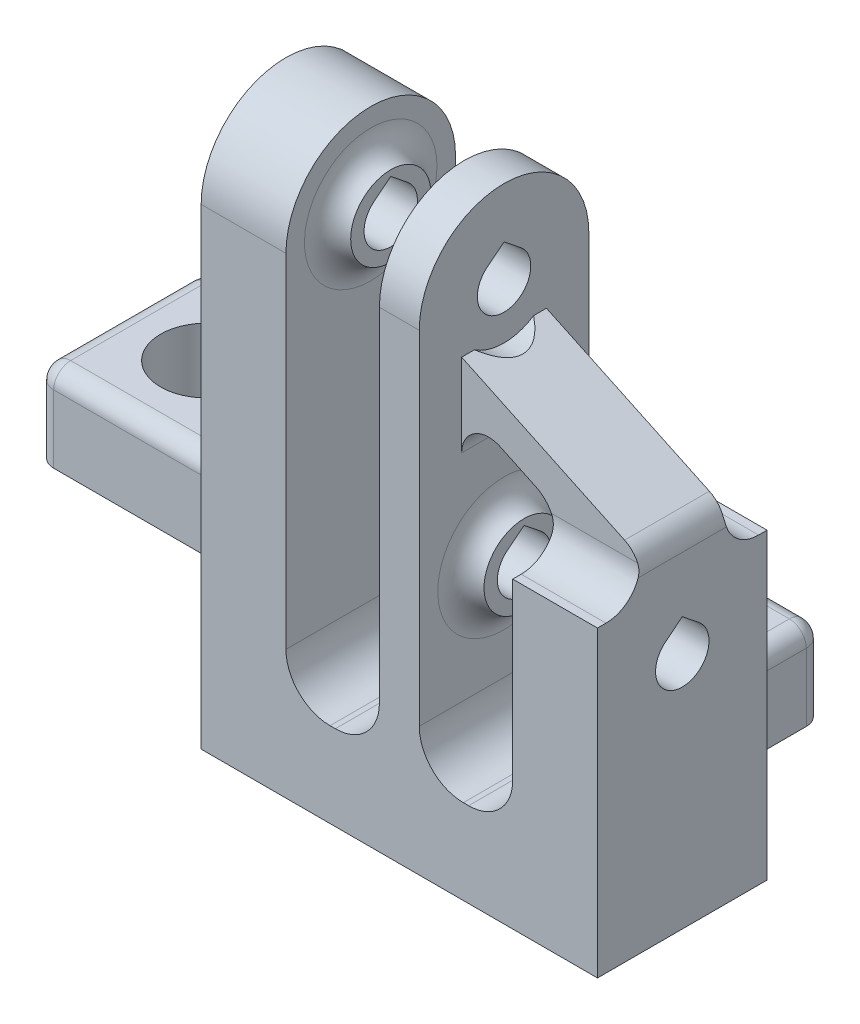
ISO-10303-21;
HEADER;
FILE_DESCRIPTION(('STEP AP214'),'2;1');
FILE_NAME('part.step','',(''),(''),'','','');
FILE_SCHEMA(('AUTOMOTIVE_DESIGN { 1 0 10303 214 1 1 1 1 }'));
ENDSEC;
DATA;
#1=APPLICATION_CONTEXT('core data for automotive mechanical design processes');
#2=APPLICATION_PROTOCOL_DEFINITION('international standard','automotive_design',2000,#1);
#3=PRODUCT_CONTEXT('',#1,'mechanical');
#4=PRODUCT('Part','Part','',(#3));
#5=PRODUCT_RELATED_PRODUCT_CATEGORY('part','',(#4));
#6=PRODUCT_DEFINITION_FORMATION('','',#4);
#7=PRODUCT_DEFINITION_CONTEXT('part definition',#1,'design');
#8=PRODUCT_DEFINITION('design','',#6,#7);
#9=PRODUCT_DEFINITION_SHAPE('','',#8);
#10=(LENGTH_UNIT() NAMED_UNIT(*) SI_UNIT(.MILLI.,.METRE.));
#11=(NAMED_UNIT(*) PLANE_ANGLE_UNIT() SI_UNIT($,.RADIAN.));
#12=(NAMED_UNIT(*) SI_UNIT($,.STERADIAN.) SOLID_ANGLE_UNIT());
#13=UNCERTAINTY_MEASURE_WITH_UNIT(LENGTH_MEASURE(1.E-05),#10,'distance_accuracy_value','');
#14=(GEOMETRIC_REPRESENTATION_CONTEXT(3) GLOBAL_UNCERTAINTY_ASSIGNED_CONTEXT((#13)) GLOBAL_UNIT_ASSIGNED_CONTEXT((#10,
#11,#12)) REPRESENTATION_CONTEXT('',''));
#15=CARTESIAN_POINT('',(0.,0.,0.));
#16=DIRECTION('',(0.,0.,1.));
#17=DIRECTION('',(1.,0.,0.));
#18=AXIS2_PLACEMENT_3D('',#15,#16,#17);
#19=CARTESIAN_POINT('',(-8.492499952,0.,0.));
#20=DIRECTION('',(-1.,0.,0.));
#21=DIRECTION('',(0.,-1.,0.));
#22=AXIS2_PLACEMENT_3D('',#19,#20,#21);
#23=PLANE('',#22);
#24=CARTESIAN_POINT('',(-8.492499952,14.493379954,6.35));
#25=DIRECTION('',(-1.,0.,0.));
#26=DIRECTION('',(0.,-1.,0.));
#27=AXIS2_PLACEMENT_3D('',#24,#25,#26);
#28=CIRCLE('',#27,4.96112212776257);
#29=CARTESIAN_POINT('',(-8.492499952,9.53225782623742,6.35));
#30=VERTEX_POINT('',#29);
#31=EDGE_CURVE('E459',#30,#30,#28,.T.);
#32=ORIENTED_EDGE('',*,*,#31,.T.);
#33=EDGE_LOOP('',(#32));
#34=FACE_BOUND('',#33,.T.);
#35=CARTESIAN_POINT('',(-8.492499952,14.493379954,6.35));
#36=DIRECTION('',(-1.,0.,0.));
#37=DIRECTION('',(0.,-1.,0.));
#38=AXIS2_PLACEMENT_3D('',#35,#36,#37);
#39=CIRCLE('',#38,6.35);
#40=CARTESIAN_POINT('',(-8.49249995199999,14.493379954,12.7));
#41=VERTEX_POINT('',#40);
#42=CARTESIAN_POINT('',(-8.49249995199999,14.493379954,0.));
#43=VERTEX_POINT('',#42);
#44=EDGE_CURVE('E812',#41,#43,#39,.T.);
#45=ORIENTED_EDGE('',*,*,#44,.F.);
#46=DIRECTION('',(0.,-1.,0.));
#47=VECTOR('',#46,1.);
#48=CARTESIAN_POINT('',(-8.492499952,0.,12.7));
#49=LINE('',#48,#47);
#50=CARTESIAN_POINT('',(-8.492499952,-11.191379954,12.7));
#51=VERTEX_POINT('',#50);
#52=EDGE_CURVE('E875',#41,#51,#49,.T.);
#53=ORIENTED_EDGE('',*,*,#52,.T.);
#54=DIRECTION('',(0.,0.,1.));
#55=VECTOR('',#54,1.);
#56=CARTESIAN_POINT('',(-8.492499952,-11.191379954,0.));
#57=LINE('',#56,#55);
#58=CARTESIAN_POINT('',(-8.492499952,-11.191379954,0.));
#59=VERTEX_POINT('',#58);
#60=EDGE_CURVE('E951',#51,#59,#57,.F.);
#61=ORIENTED_EDGE('',*,*,#60,.T.);
#62=DIRECTION('',(0.,-1.,0.));
#63=VECTOR('',#62,1.);
#64=CARTESIAN_POINT('',(-8.492499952,0.,0.));
#65=LINE('',#64,#63);
#66=EDGE_CURVE('E874',#43,#59,#65,.T.);
#67=ORIENTED_EDGE('',*,*,#66,.F.);
#68=EDGE_LOOP('',(#45,#53,#61,#67));
#69=FACE_BOUND('',#68,.T.);
#70=ADVANCED_FACE('F53',(#34,#69),#23,.F.);
#71=CARTESIAN_POINT('',(1.492499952,0.,12.7));
#72=DIRECTION('',(1.,0.,0.));
#73=DIRECTION('',(0.,1.,0.));
#74=AXIS2_PLACEMENT_3D('',#71,#72,#73);
#75=PLANE('',#74);
#76=DIRECTION('',(0.,0.624810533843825,0.780776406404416));
#77=VECTOR('',#76,1.);
#78=CARTESIAN_POINT('',(1.492499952,16.0549327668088,5.10037893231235));
#79=LINE('',#78,#77);
#80=CARTESIAN_POINT('',(1.492499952,16.0549327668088,5.10037893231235));
#81=VERTEX_POINT('',#80);
#82=CARTESIAN_POINT('',(1.492499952,17.0549327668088,6.35));
#83=VERTEX_POINT('',#82);
#84=EDGE_CURVE('E774',#81,#83,#79,.T.);
#85=ORIENTED_EDGE('',*,*,#84,.F.);
#86=CARTESIAN_POINT('',(1.492499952,14.493379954,6.35));
#87=DIRECTION('',(1.,0.,0.));
#88=DIRECTION('',(0.,1.,0.));
#89=AXIS2_PLACEMENT_3D('',#86,#87,#88);
#90=CIRCLE('',#89,2.);
#91=CARTESIAN_POINT('',(1.492499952,16.0549327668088,7.59962106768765));
#92=VERTEX_POINT('',#91);
#93=EDGE_CURVE('E919',#92,#81,#90,.T.);
#94=ORIENTED_EDGE('',*,*,#93,.F.);
#95=DIRECTION('',(0.,-0.624810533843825,0.780776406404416));
#96=VECTOR('',#95,1.);
#97=CARTESIAN_POINT('',(1.492499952,17.0549327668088,6.35));
#98=LINE('',#97,#96);
#99=EDGE_CURVE('E779',#83,#92,#98,.T.);
#100=ORIENTED_EDGE('',*,*,#99,.F.);
#101=EDGE_LOOP('',(#85,#94,#100));
#102=FACE_BOUND('',#101,.T.);
#103=CARTESIAN_POINT('',(1.492499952,-3.14438004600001,6.35));
#104=DIRECTION('',(1.,0.,0.));
#105=DIRECTION('',(0.,1.,0.));
#106=AXIS2_PLACEMENT_3D('',#103,#104,#105);
#107=CIRCLE('',#106,4.96112212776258);
#108=CARTESIAN_POINT('',(1.492499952,1.81674208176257,6.35));
#109=VERTEX_POINT('',#108);
#110=EDGE_CURVE('E468',#109,#109,#107,.F.);
#111=ORIENTED_EDGE('',*,*,#110,.T.);
#112=EDGE_LOOP('',(#111));
#113=FACE_BOUND('',#112,.T.);
#114=DIRECTION('',(0.,0.,1.));
#115=VECTOR('',#114,1.);
#116=CARTESIAN_POINT('',(1.492499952,4.95534722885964,12.7));
#117=LINE('',#116,#115);
#118=CARTESIAN_POINT('',(1.492499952,4.95534722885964,3.175));
#119=VERTEX_POINT('',#118);
#120=CARTESIAN_POINT('',(1.492499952,4.95534722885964,9.525));
#121=VERTEX_POINT('',#120);
#122=EDGE_CURVE('E446',#119,#121,#117,.T.);
#123=ORIENTED_EDGE('',*,*,#122,.T.);
#124=DIRECTION('',(0.,1.,0.));
#125=VECTOR('',#124,1.);
#126=CARTESIAN_POINT('',(1.492499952,0.,9.525));
#127=LINE('',#126,#125);
#128=CARTESIAN_POINT('',(1.492499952,11.1627065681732,9.525));
#129=VERTEX_POINT('',#128);
#130=EDGE_CURVE('E831',#121,#129,#127,.T.);
#131=ORIENTED_EDGE('',*,*,#130,.T.);
#132=DIRECTION('',(0.,0.,1.));
#133=VECTOR('',#132,1.);
#134=CARTESIAN_POINT('',(1.492499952,11.1627065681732,3.175));
#135=LINE('',#134,#133);
#136=CARTESIAN_POINT('',(1.492499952,11.1627065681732,8.56508798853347));
#137=VERTEX_POINT('',#136);
#138=EDGE_CURVE('E828',#137,#129,#135,.T.);
#139=ORIENTED_EDGE('',*,*,#138,.F.);
#140=CARTESIAN_POINT('',(1.492499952,14.493379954,6.35));
#141=DIRECTION('',(1.,0.,0.));
#142=DIRECTION('',(0.,1.,0.));
#143=AXIS2_PLACEMENT_3D('',#140,#141,#142);
#144=CIRCLE('',#143,4.);
#145=CARTESIAN_POINT('',(1.492499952,11.1627065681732,4.13491201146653));
#146=VERTEX_POINT('',#145);
#147=EDGE_CURVE('E816',#137,#146,#144,.T.);
#148=ORIENTED_EDGE('',*,*,#147,.T.);
#149=CARTESIAN_POINT('',(1.492499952,11.1627065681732,3.175));
#150=VERTEX_POINT('',#149);
#151=EDGE_CURVE('E836',#150,#146,#135,.T.);
#152=ORIENTED_EDGE('',*,*,#151,.F.);
#153=DIRECTION('',(0.,1.,0.));
#154=VECTOR('',#153,1.);
#155=CARTESIAN_POINT('',(1.492499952,0.,3.175));
#156=LINE('',#155,#154);
#157=EDGE_CURVE('E822',#119,#150,#156,.T.);
#158=ORIENTED_EDGE('',*,*,#157,.F.);
#159=EDGE_LOOP('',(#123,#131,#139,#148,#152,#158));
#160=FACE_BOUND('',#159,.T.);
#161=CARTESIAN_POINT('',(1.492499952,14.493379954,6.35));
#162=DIRECTION('',(1.,0.,0.));
#163=DIRECTION('',(0.,1.,0.));
#164=AXIS2_PLACEMENT_3D('',#161,#162,#163);
#165=CIRCLE('',#164,6.35);
#166=CARTESIAN_POINT('',(1.492499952,14.493379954,0.));
#167=VERTEX_POINT('',#166);
#168=CARTESIAN_POINT('',(1.49249995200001,14.493379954,12.7));
#169=VERTEX_POINT('',#168);
#170=EDGE_CURVE('E810',#167,#169,#165,.T.);
#171=ORIENTED_EDGE('',*,*,#170,.T.);
#172=DIRECTION('',(0.,-1.,0.));
#173=VECTOR('',#172,1.);
#174=CARTESIAN_POINT('',(1.492499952,0.,12.7));
#175=LINE('',#174,#173);
#176=CARTESIAN_POINT('',(1.492499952,-11.191379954,12.7));
#177=VERTEX_POINT('',#176);
#178=EDGE_CURVE('E925',#169,#177,#175,.T.);
#179=ORIENTED_EDGE('',*,*,#178,.T.);
#180=DIRECTION('',(0.,0.,-1.));
#181=VECTOR('',#180,1.);
#182=CARTESIAN_POINT('',(1.492499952,-11.191379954,12.7));
#183=LINE('',#182,#181);
#184=CARTESIAN_POINT('',(1.492499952,-11.191379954,0.));
#185=VERTEX_POINT('',#184);
#186=EDGE_CURVE('E431',#177,#185,#183,.T.);
#187=ORIENTED_EDGE('',*,*,#186,.T.);
#188=DIRECTION('',(0.,-1.,0.));
#189=VECTOR('',#188,1.);
#190=CARTESIAN_POINT('',(1.492499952,0.,0.));
#191=LINE('',#190,#189);
#192=EDGE_CURVE('E926',#167,#185,#191,.T.);
#193=ORIENTED_EDGE('',*,*,#192,.F.);
#194=EDGE_LOOP('',(#171,#179,#187,#193));
#195=FACE_BOUND('',#194,.T.);
#196=ADVANCED_FACE('F628',(#102,#113,#160,#195),#75,.T.);
#197=CARTESIAN_POINT('',(-1.492499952,0.,12.7));
#198=DIRECTION('',(1.,0.,0.));
#199=DIRECTION('',(0.,1.,0.));
#200=AXIS2_PLACEMENT_3D('',#197,#198,#199);
#201=PLANE('',#200);
#202=CARTESIAN_POINT('',(-1.492499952,14.493379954,6.35));
#203=DIRECTION('',(1.,0.,0.));
#204=DIRECTION('',(0.,1.,0.));
#205=AXIS2_PLACEMENT_3D('',#202,#203,#204);
#206=CIRCLE('',#205,4.96112212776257);
#207=CARTESIAN_POINT('',(-1.492499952,19.4545020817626,6.35));
#208=VERTEX_POINT('',#207);
#209=EDGE_CURVE('E462',#208,#208,#206,.T.);
#210=ORIENTED_EDGE('',*,*,#209,.T.);
#211=EDGE_LOOP('',(#210));
#212=FACE_BOUND('',#211,.T.);
#213=CARTESIAN_POINT('',(-1.492499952,-3.14438004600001,6.35));
#214=DIRECTION('',(1.,0.,0.));
#215=DIRECTION('',(0.,1.,0.));
#216=AXIS2_PLACEMENT_3D('',#213,#214,#215);
#217=CIRCLE('',#216,2.);
#218=CARTESIAN_POINT('',(-1.492499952,-1.58282723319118,5.10037893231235));
#219=VERTEX_POINT('',#218);
#220=CARTESIAN_POINT('',(-1.492499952,-1.58282723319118,7.59962106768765));
#221=VERTEX_POINT('',#220);
#222=EDGE_CURVE('E910',#219,#221,#217,.F.);
#223=ORIENTED_EDGE('',*,*,#222,.F.);
#224=DIRECTION('',(0.,-0.624810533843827,-0.780776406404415));
#225=VECTOR('',#224,1.);
#226=CARTESIAN_POINT('',(-1.492499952,-1.58282723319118,5.10037893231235));
#227=LINE('',#226,#225);
#228=CARTESIAN_POINT('',(-1.492499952,-0.582827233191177,6.35));
#229=VERTEX_POINT('',#228);
#230=EDGE_CURVE('E751',#229,#219,#227,.T.);
#231=ORIENTED_EDGE('',*,*,#230,.F.);
#232=DIRECTION('',(0.,0.624810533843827,-0.780776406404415));
#233=VECTOR('',#232,1.);
#234=CARTESIAN_POINT('',(-1.492499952,-0.582827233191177,6.35));
#235=LINE('',#234,#233);
#236=EDGE_CURVE('E753',#221,#229,#235,.T.);
#237=ORIENTED_EDGE('',*,*,#236,.F.);
#238=EDGE_LOOP('',(#223,#231,#237));
#239=FACE_BOUND('',#238,.T.);
#240=DIRECTION('',(0.,-1.,0.));
#241=VECTOR('',#240,1.);
#242=CARTESIAN_POINT('',(-1.492499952,0.,12.7));
#243=LINE('',#242,#241);
#244=CARTESIAN_POINT('',(-1.49249995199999,14.493379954,12.7));
#245=VERTEX_POINT('',#244);
#246=CARTESIAN_POINT('',(-1.492499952,-11.191379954,12.7));
#247=VERTEX_POINT('',#246);
#248=EDGE_CURVE('E923',#245,#247,#243,.T.);
#249=ORIENTED_EDGE('',*,*,#248,.F.);
#250=CARTESIAN_POINT('',(-1.492499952,14.493379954,6.35));
#251=DIRECTION('',(1.,0.,0.));
#252=DIRECTION('',(0.,1.,0.));
#253=AXIS2_PLACEMENT_3D('',#250,#251,#252);
#254=CIRCLE('',#253,6.35);
#255=CARTESIAN_POINT('',(-1.49249995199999,14.493379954,0.));
#256=VERTEX_POINT('',#255);
#257=EDGE_CURVE('E808',#256,#245,#254,.T.);
#258=ORIENTED_EDGE('',*,*,#257,.F.);
#259=DIRECTION('',(0.,-1.,0.));
#260=VECTOR('',#259,1.);
#261=CARTESIAN_POINT('',(-1.492499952,0.,0.));
#262=LINE('',#261,#260);
#263=CARTESIAN_POINT('',(-1.492499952,-11.191379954,0.));
#264=VERTEX_POINT('',#263);
#265=EDGE_CURVE('E922',#256,#264,#262,.T.);
#266=ORIENTED_EDGE('',*,*,#265,.T.);
#267=DIRECTION('',(0.,0.,-1.));
#268=VECTOR('',#267,1.);
#269=CARTESIAN_POINT('',(-1.492499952,-11.191379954,12.7));
#270=LINE('',#269,#268);
#271=EDGE_CURVE('E948',#264,#247,#270,.F.);
#272=ORIENTED_EDGE('',*,*,#271,.T.);
#273=EDGE_LOOP('',(#249,#258,#266,#272));
#274=FACE_BOUND('',#273,.T.);
#275=ADVANCED_FACE('F576',(#212,#239,#274),#201,.F.);
#276=CARTESIAN_POINT('',(-14.842499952,0.,0.));
#277=DIRECTION('',(-1.,0.,0.));
#278=DIRECTION('',(0.,-1.,0.));
#279=AXIS2_PLACEMENT_3D('',#276,#277,#278);
#280=PLANE('',#279);
#281=DIRECTION('',(0.,0.624810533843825,0.780776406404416));
#282=VECTOR('',#281,1.);
#283=CARTESIAN_POINT('',(-14.842499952,16.0549327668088,5.10037893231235));
#284=LINE('',#283,#282);
#285=CARTESIAN_POINT('',(-14.842499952,16.0549327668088,5.10037893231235));
#286=VERTEX_POINT('',#285);
#287=CARTESIAN_POINT('',(-14.842499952,17.0549327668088,6.35));
#288=VERTEX_POINT('',#287);
#289=EDGE_CURVE('E775',#286,#288,#284,.T.);
#290=ORIENTED_EDGE('',*,*,#289,.T.);
#291=DIRECTION('',(0.,-0.624810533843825,0.780776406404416));
#292=VECTOR('',#291,1.);
#293=CARTESIAN_POINT('',(-14.842499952,17.0549327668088,6.35));
#294=LINE('',#293,#292);
#295=CARTESIAN_POINT('',(-14.842499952,16.0549327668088,7.59962106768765));
#296=VERTEX_POINT('',#295);
#297=EDGE_CURVE('E778',#288,#296,#294,.T.);
#298=ORIENTED_EDGE('',*,*,#297,.T.);
#299=CARTESIAN_POINT('',(-14.842499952,14.493379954,6.35));
#300=DIRECTION('',(-1.,0.,0.));
#301=DIRECTION('',(0.,-1.,0.));
#302=AXIS2_PLACEMENT_3D('',#299,#300,#301);
#303=CIRCLE('',#302,2.);
#304=EDGE_CURVE('E865',#286,#296,#303,.T.);
#305=ORIENTED_EDGE('',*,*,#304,.F.);
#306=EDGE_LOOP('',(#290,#298,#305));
#307=FACE_BOUND('',#306,.T.);
#308=DIRECTION('',(0.,0.,1.));
#309=VECTOR('',#308,1.);
#310=CARTESIAN_POINT('',(-14.842499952,-14.493379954,0.));
#311=LINE('',#310,#309);
#312=CARTESIAN_POINT('',(-14.842499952,-14.493379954,-1.27));
#313=VERTEX_POINT('',#312);
#314=CARTESIAN_POINT('',(-14.842499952,-14.493379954,3.04094988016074));
#315=VERTEX_POINT('',#314);
#316=EDGE_CURVE('E480',#313,#315,#311,.T.);
#317=ORIENTED_EDGE('',*,*,#316,.T.);
#318=CARTESIAN_POINT('',(-14.842499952,-14.493379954,3.04094988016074));
#319=CARTESIAN_POINT('',(-14.842499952,-14.4933946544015,3.1300708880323));
#320=CARTESIAN_POINT('',(-14.842499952,-14.4958679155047,3.21916230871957));
#321=CARTESIAN_POINT('',(-14.842499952,-14.5052010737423,3.39706657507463));
#322=CARTESIAN_POINT('',(-14.842499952,-14.5120583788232,3.4858795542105));
#323=CARTESIAN_POINT('',(-14.842499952,-14.5296063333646,3.66287042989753));
#324=CARTESIAN_POINT('',(-14.842499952,-14.5402864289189,3.75104939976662));
#325=CARTESIAN_POINT('',(-14.842499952,-14.5650507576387,3.92693640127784));
#326=CARTESIAN_POINT('',(-14.842499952,-14.5791355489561,4.01464435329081));
#327=CARTESIAN_POINT('',(-14.842499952,-14.6256000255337,4.27525482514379));
#328=CARTESIAN_POINT('',(-14.842499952,-14.662377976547,4.44737888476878));
#329=CARTESIAN_POINT('',(-14.842499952,-14.7452210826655,4.78946023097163));
#330=CARTESIAN_POINT('',(-14.842499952,-14.7912936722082,4.95941566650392));
#331=CARTESIAN_POINT('',(-14.842499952,-14.9029871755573,5.33915979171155));
#332=CARTESIAN_POINT('',(-14.842499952,-14.9706207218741,5.54835138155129));
#333=CARTESIAN_POINT('',(-14.842499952,-15.1137845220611,5.96403078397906));
#334=CARTESIAN_POINT('',(-14.842499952,-15.189317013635,6.17051781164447));
#335=CARTESIAN_POINT('',(-14.842499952,-15.4237678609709,6.78792959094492));
#336=CARTESIAN_POINT('',(-14.842499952,-15.590256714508,7.19593388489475));
#337=CARTESIAN_POINT('',(-14.842499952,-15.7589808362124,7.60922437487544));
#338=CARTESIAN_POINT('',(-14.842499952,-15.7611804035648,7.61461219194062));
#339=CARTESIAN_POINT('',(-14.842499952,-15.763379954,7.62));
#340=B_SPLINE_CURVE_WITH_KNOTS('',3,(#318,#319,#320,#321,#322,#323,#324,#325,#326,#327,#328,
#329,#330,#331,#332,#333,#334,#335,#336,#337,#338,#339),.UNSPECIFIED.,.F.,.F.,(4,2,2,2,2,2,2,2,
2,2,4),(0.,0.267286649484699,0.534415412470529,0.800812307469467,1.06725290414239,
1.59491100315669,2.12299284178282,2.78230932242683,3.44181309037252,4.76356437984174,
4.78102290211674),.UNSPECIFIED.);
#341=CARTESIAN_POINT('',(-14.842499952,-15.763379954,7.62));
#342=VERTEX_POINT('',#341);
#343=EDGE_CURVE('E551',#315,#342,#340,.T.);
#344=ORIENTED_EDGE('',*,*,#343,.T.);
#345=DIRECTION('',(0.,-1.,0.));
#346=VECTOR('',#345,1.);
#347=CARTESIAN_POINT('',(-14.842499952,-20.843379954,7.62));
#348=LINE('',#347,#346);
#349=CARTESIAN_POINT('',(-14.842499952,-20.843379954,7.62));
#350=VERTEX_POINT('',#349);
#351=EDGE_CURVE('E483',#342,#350,#348,.T.);
#352=ORIENTED_EDGE('',*,*,#351,.T.);
#353=DIRECTION('',(0.,0.,1.));
#354=VECTOR('',#353,1.);
#355=CARTESIAN_POINT('',(-14.842499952,-20.843379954,0.));
#356=LINE('',#355,#354);
#357=CARTESIAN_POINT('',(-14.842499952,-20.843379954,12.7));
#358=VERTEX_POINT('',#357);
#359=EDGE_CURVE('E877',#350,#358,#356,.T.);
#360=ORIENTED_EDGE('',*,*,#359,.T.);
#361=DIRECTION('',(0.,-1.,0.));
#362=VECTOR('',#361,1.);
#363=CARTESIAN_POINT('',(-14.842499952,0.,12.7));
#364=LINE('',#363,#362);
#365=CARTESIAN_POINT('',(-14.842499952,14.493379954,12.7));
#366=VERTEX_POINT('',#365);
#367=EDGE_CURVE('E868',#366,#358,#364,.T.);
#368=ORIENTED_EDGE('',*,*,#367,.F.);
#369=CARTESIAN_POINT('',(-14.842499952,14.493379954,6.35));
#370=DIRECTION('',(-1.,0.,0.));
#371=DIRECTION('',(0.,-1.,0.));
#372=AXIS2_PLACEMENT_3D('',#369,#370,#371);
#373=CIRCLE('',#372,6.35);
#374=CARTESIAN_POINT('',(-14.842499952,14.493379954,0.));
#375=VERTEX_POINT('',#374);
#376=EDGE_CURVE('E802',#366,#375,#373,.T.);
#377=ORIENTED_EDGE('',*,*,#376,.T.);
#378=DIRECTION('',(0.,-1.,0.));
#379=VECTOR('',#378,1.);
#380=CARTESIAN_POINT('',(-14.842499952,0.,0.));
#381=LINE('',#380,#379);
#382=CARTESIAN_POINT('',(-14.842499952,-13.223379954,0.));
#383=VERTEX_POINT('',#382);
#384=EDGE_CURVE('E871',#375,#383,#381,.T.);
#385=ORIENTED_EDGE('',*,*,#384,.T.);
#386=CARTESIAN_POINT('',(-14.842499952,-13.223379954,-1.27));
#387=DIRECTION('',(-1.,0.,0.));
#388=DIRECTION('',(0.,-1.,0.));
#389=AXIS2_PLACEMENT_3D('',#386,#387,#388);
#390=CIRCLE('',#389,1.27);
#391=EDGE_CURVE('E1004',#383,#313,#390,.F.);
#392=ORIENTED_EDGE('',*,*,#391,.T.);
#393=EDGE_LOOP('',(#317,#344,#352,#360,#368,#377,#385,#392));
#394=FACE_BOUND('',#393,.T.);
#395=ADVANCED_FACE('F571',(#307,#394),#280,.T.);
#396=CARTESIAN_POINT('',(0.,0.,0.));
#397=DIRECTION('',(0.,0.,1.));
#398=DIRECTION('',(1.,0.,0.));
#399=AXIS2_PLACEMENT_3D('',#396,#397,#398);
#400=PLANE('',#399);
#401=CARTESIAN_POINT('',(4.794499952,-11.191379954,0.));
#402=DIRECTION('',(0.,0.,1.));
#403=DIRECTION('',(1.,0.,0.));
#404=AXIS2_PLACEMENT_3D('',#401,#402,#403);
#405=CIRCLE('',#404,3.302);
#406=CARTESIAN_POINT('',(2.19177445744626,-13.223379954,0.));
#407=VERTEX_POINT('',#406);
#408=EDGE_CURVE('E442',#185,#407,#405,.T.);
#409=ORIENTED_EDGE('',*,*,#408,.T.);
#410=DIRECTION('',(-1.,0.,0.));
#411=VECTOR('',#410,1.);
#412=CARTESIAN_POINT('',(-4.794499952,-13.223379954,0.));
#413=LINE('',#412,#411);
#414=CARTESIAN_POINT('',(-2.19177445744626,-13.223379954,0.));
#415=VERTEX_POINT('',#414);
#416=EDGE_CURVE('E549',#407,#415,#413,.T.);
#417=ORIENTED_EDGE('',*,*,#416,.T.);
#418=CARTESIAN_POINT('',(-4.794499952,-11.191379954,0.));
#419=DIRECTION('',(0.,0.,1.));
#420=DIRECTION('',(1.,0.,0.));
#421=AXIS2_PLACEMENT_3D('',#418,#419,#420);
#422=CIRCLE('',#421,3.302);
#423=EDGE_CURVE('E954',#415,#264,#422,.T.);
#424=ORIENTED_EDGE('',*,*,#423,.T.);
#425=ORIENTED_EDGE('',*,*,#265,.F.);
#426=DIRECTION('',(-1.,0.,0.));
#427=VECTOR('',#426,1.);
#428=CARTESIAN_POINT('',(14.842499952,14.493379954,0.));
#429=LINE('',#428,#427);
#430=EDGE_CURVE('E807',#167,#256,#429,.T.);
#431=ORIENTED_EDGE('',*,*,#430,.F.);
#432=ORIENTED_EDGE('',*,*,#192,.T.);
#433=EDGE_LOOP('',(#409,#417,#424,#425,#431,#432));
#434=FACE_BOUND('',#433,.T.);
#435=ADVANCED_FACE('F575',(#434),#400,.F.);
#436=CARTESIAN_POINT('',(-5.190499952,-11.191379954,25.4));
#437=DIRECTION('',(0.,0.,-1.));
#438=DIRECTION('',(-1.,0.,0.));
#439=AXIS2_PLACEMENT_3D('',#436,#437,#438);
#440=CYLINDRICAL_SURFACE('',#439,3.302);
#441=CARTESIAN_POINT('',(-5.190499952,-11.191379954,12.7));
#442=DIRECTION('',(0.,0.,-1.));
#443=DIRECTION('',(-1.,0.,0.));
#444=AXIS2_PLACEMENT_3D('',#441,#442,#443);
#445=CIRCLE('',#444,3.302);
#446=CARTESIAN_POINT('',(-5.190499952,-14.493379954,12.7));
#447=VERTEX_POINT('',#446);
#448=EDGE_CURVE('E958',#447,#51,#445,.T.);
#449=ORIENTED_EDGE('',*,*,#448,.F.);
#450=DIRECTION('',(0.,0.,1.));
#451=VECTOR('',#450,1.);
#452=CARTESIAN_POINT('',(-5.190499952,-14.493379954,12.7));
#453=LINE('',#452,#451);
#454=CARTESIAN_POINT('',(-5.190499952,-14.493379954,-1.27));
#455=VERTEX_POINT('',#454);
#456=EDGE_CURVE('E943',#455,#447,#453,.T.);
#457=ORIENTED_EDGE('',*,*,#456,.F.);
#458=CARTESIAN_POINT('',(-7.79322544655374,-13.223379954,0.));
#459=CARTESIAN_POINT('',(-7.75986690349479,-13.2661185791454,-5.35477081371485E-06));
#460=CARTESIAN_POINT('',(-7.72547628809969,-13.3079875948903,-0.00215613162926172));
#461=CARTESIAN_POINT('',(-7.65493125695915,-13.3897160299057,-0.0102704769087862));
#462=CARTESIAN_POINT('',(-7.61877978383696,-13.4295785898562,-0.0162278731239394));
#463=CARTESIAN_POINT('',(-7.50865575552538,-13.5452312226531,-0.0389643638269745));
#464=CARTESIAN_POINT('',(-7.43238226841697,-13.6178902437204,-0.0606260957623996));
#465=CARTESIAN_POINT('',(-7.23839497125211,-13.7861280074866,-0.126405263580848));
#466=CARTESIAN_POINT('',(-7.11808222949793,-13.8763848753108,-0.176293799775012));
#467=CARTESIAN_POINT('',(-6.87075671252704,-14.0377686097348,-0.290458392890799));
#468=CARTESIAN_POINT('',(-6.74370716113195,-14.1087739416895,-0.354821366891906));
#469=CARTESIAN_POINT('',(-6.52341222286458,-14.2140930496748,-0.472707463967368));
#470=CARTESIAN_POINT('',(-6.43110204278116,-14.2530696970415,-0.523925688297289));
#471=CARTESIAN_POINT('',(-6.24507324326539,-14.3220230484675,-0.629784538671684));
#472=CARTESIAN_POINT('',(-6.15135400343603,-14.3519956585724,-0.68442670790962));
#473=CARTESIAN_POINT('',(-5.86920851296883,-14.4287399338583,-0.851630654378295));
#474=CARTESIAN_POINT('',(-5.67922676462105,-14.4626027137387,-0.96778423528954));
#475=CARTESIAN_POINT('',(-5.3927402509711,-14.4885928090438,-1.14458863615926));
#476=CARTESIAN_POINT('',(-5.29650355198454,-14.4930809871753,-1.20425977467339));
#477=CARTESIAN_POINT('',(-5.19701117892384,-14.4933751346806,-1.2659619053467));
#478=CARTESIAN_POINT('',(-5.19375556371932,-14.4933799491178,-1.26798095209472));
#479=CARTESIAN_POINT('',(-5.190499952,-14.493379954,-1.27));
#480=B_SPLINE_CURVE_WITH_KNOTS('',3,(#458,#459,#460,#461,#462,#463,#464,#465,#466,#467,#468,
#469,#470,#471,#472,#473,#474,#475,#476,#477,#478,#479),.UNSPECIFIED.,.F.,.F.,(4,2,2,2,2,2,2,2,
2,2,4),(0.,0.16250994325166,0.32475705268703,0.646221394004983,1.11908353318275,
1.59486478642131,1.93203342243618,2.26935513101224,2.94192043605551,3.28164488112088,
3.29313749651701),.UNSPECIFIED.);
#481=CARTESIAN_POINT('',(-7.79322544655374,-13.223379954,0.));
#482=VERTEX_POINT('',#481);
#483=EDGE_CURVE('E999',#455,#482,#480,.F.);
#484=ORIENTED_EDGE('',*,*,#483,.T.);
#485=CARTESIAN_POINT('',(-5.190499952,-11.191379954,0.));
#486=DIRECTION('',(0.,0.,-1.));
#487=DIRECTION('',(-1.,0.,0.));
#488=AXIS2_PLACEMENT_3D('',#485,#486,#487);
#489=CIRCLE('',#488,3.302);
#490=EDGE_CURVE('E960',#59,#482,#489,.F.);
#491=ORIENTED_EDGE('',*,*,#490,.F.);
#492=ORIENTED_EDGE('',*,*,#60,.F.);
#493=EDGE_LOOP('',(#449,#457,#484,#491,#492));
#494=FACE_BOUND('',#493,.T.);
#495=ADVANCED_FACE('F626',(#494),#440,.F.);
#496=CARTESIAN_POINT('',(5.190499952,-11.191379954,0.));
#497=DIRECTION('',(0.,0.,-1.));
#498=DIRECTION('',(-1.,0.,0.));
#499=AXIS2_PLACEMENT_3D('',#496,#497,#498);
#500=CYLINDRICAL_SURFACE('',#499,3.302);
#501=DIRECTION('',(0.,0.,1.));
#502=VECTOR('',#501,1.);
#503=CARTESIAN_POINT('',(5.190499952,-14.493379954,0.));
#504=LINE('',#503,#502);
#505=CARTESIAN_POINT('',(5.190499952,-14.493379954,12.7));
#506=VERTEX_POINT('',#505);
#507=CARTESIAN_POINT('',(5.190499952,-14.493379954,0.));
#508=VERTEX_POINT('',#507);
#509=EDGE_CURVE('E411',#506,#508,#504,.F.);
#510=ORIENTED_EDGE('',*,*,#509,.F.);
#511=CARTESIAN_POINT('',(5.190499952,-11.191379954,12.7));
#512=DIRECTION('',(0.,0.,-1.));
#513=DIRECTION('',(-1.,0.,0.));
#514=AXIS2_PLACEMENT_3D('',#511,#512,#513);
#515=CIRCLE('',#514,3.302);
#516=CARTESIAN_POINT('',(8.492499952,-11.191379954,12.7));
#517=VERTEX_POINT('',#516);
#518=EDGE_CURVE('E422',#517,#506,#515,.T.);
#519=ORIENTED_EDGE('',*,*,#518,.F.);
#520=DIRECTION('',(0.,0.,1.));
#521=VECTOR('',#520,1.);
#522=CARTESIAN_POINT('',(8.492499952,-11.191379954,12.7));
#523=LINE('',#522,#521);
#524=CARTESIAN_POINT('',(8.492499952,-11.191379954,0.));
#525=VERTEX_POINT('',#524);
#526=EDGE_CURVE('E437',#525,#517,#523,.T.);
#527=ORIENTED_EDGE('',*,*,#526,.F.);
#528=CARTESIAN_POINT('',(5.190499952,-11.191379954,0.));
#529=DIRECTION('',(0.,0.,-1.));
#530=DIRECTION('',(-1.,0.,0.));
#531=AXIS2_PLACEMENT_3D('',#528,#529,#530);
#532=CIRCLE('',#531,3.302);
#533=EDGE_CURVE('E430',#508,#525,#532,.F.);
#534=ORIENTED_EDGE('',*,*,#533,.F.);
#535=EDGE_LOOP('',(#510,#519,#527,#534));
#536=FACE_BOUND('',#535,.T.);
#537=ADVANCED_FACE('F433',(#536),#500,.F.);
#538=CARTESIAN_POINT('',(4.58375102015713,9.70227299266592,3.175));
#539=DIRECTION('',(-0.42716800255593,-0.904172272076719,0.));
#540=DIRECTION('',(0.904172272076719,-0.42716800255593,0.));
#541=AXIS2_PLACEMENT_3D('',#538,#539,#540);
#542=PLANE('',#541);
#543=DIRECTION('',(0.904172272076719,-0.42716800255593,0.));
#544=VECTOR('',#543,1.);
#545=CARTESIAN_POINT('',(4.58375102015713,9.70227299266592,9.525));
#546=LINE('',#545,#544);
#547=CARTESIAN_POINT('',(13.6968359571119,5.39687853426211,9.525));
#548=VERTEX_POINT('',#547);
#549=EDGE_CURVE('E823',#129,#548,#546,.T.);
#550=ORIENTED_EDGE('',*,*,#549,.T.);
#551=DIRECTION('',(0.,0.,1.));
#552=VECTOR('',#551,1.);
#553=CARTESIAN_POINT('',(13.6968359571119,5.39687853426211,3.175));
#554=LINE('',#553,#552);
#555=CARTESIAN_POINT('',(13.6968359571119,5.39687853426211,3.175));
#556=VERTEX_POINT('',#555);
#557=EDGE_CURVE('E938',#548,#556,#554,.F.);
#558=ORIENTED_EDGE('',*,*,#557,.T.);
#559=DIRECTION('',(0.904172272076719,-0.42716800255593,0.));
#560=VECTOR('',#559,1.);
#561=CARTESIAN_POINT('',(4.58375102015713,9.70227299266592,3.175));
#562=LINE('',#561,#560);
#563=EDGE_CURVE('E825',#150,#556,#562,.T.);
#564=ORIENTED_EDGE('',*,*,#563,.F.);
#565=ORIENTED_EDGE('',*,*,#151,.T.);
#566=CARTESIAN_POINT('',(-5.55742538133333,14.493379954,6.35));
#567=DIRECTION('',(-0.42716800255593,-0.904172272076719,0.));
#568=DIRECTION('',(-0.904172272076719,0.42716800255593,0.));
#569=AXIS2_PLACEMENT_3D('',#566,#567,#568);
#570=ELLIPSE('',#569,9.36399724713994,4.);
#571=EDGE_CURVE('E928',#137,#146,#570,.F.);
#572=ORIENTED_EDGE('',*,*,#571,.F.);
#573=ORIENTED_EDGE('',*,*,#138,.T.);
#574=EDGE_LOOP('',(#550,#558,#564,#565,#572,#573));
#575=FACE_BOUND('',#574,.T.);
#576=ADVANCED_FACE('F685',(#575),#542,.F.);
#577=CARTESIAN_POINT('',(14.842499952,1.855619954,25.401));
#578=DIRECTION('',(0.,-1.,0.));
#579=DIRECTION('',(0.,0.,-1.));
#580=AXIS2_PLACEMENT_3D('',#577,#578,#579);
#581=PLANE('',#580);
#582=DIRECTION('',(0.,0.,-1.));
#583=VECTOR('',#582,1.);
#584=CARTESIAN_POINT('',(8.492499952,1.855619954,25.401));
#585=LINE('',#584,#583);
#586=CARTESIAN_POINT('',(8.492499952,1.855619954,0.635000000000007));
#587=VERTEX_POINT('',#586);
#588=CARTESIAN_POINT('',(8.492499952,1.855619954,0.));
#589=VERTEX_POINT('',#588);
#590=EDGE_CURVE('E847',#587,#589,#585,.T.);
#591=ORIENTED_EDGE('',*,*,#590,.F.);
#592=DIRECTION('',(-1.,0.,0.));
#593=VECTOR('',#592,1.);
#594=CARTESIAN_POINT('',(14.842499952,1.855619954,0.635));
#595=LINE('',#594,#593);
#596=CARTESIAN_POINT('',(14.842499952,1.855619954,0.635000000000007));
#597=VERTEX_POINT('',#596);
#598=EDGE_CURVE('E976',#587,#597,#595,.F.);
#599=ORIENTED_EDGE('',*,*,#598,.T.);
#600=DIRECTION('',(0.,0.,-1.));
#601=VECTOR('',#600,1.);
#602=CARTESIAN_POINT('',(14.842499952,1.855619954,25.401));
#603=LINE('',#602,#601);
#604=CARTESIAN_POINT('',(14.842499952,1.855619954,0.));
#605=VERTEX_POINT('',#604);
#606=EDGE_CURVE('E842',#597,#605,#603,.T.);
#607=ORIENTED_EDGE('',*,*,#606,.T.);
#608=DIRECTION('',(-1.,0.,0.));
#609=VECTOR('',#608,1.);
#610=CARTESIAN_POINT('',(14.842499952,1.855619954,0.));
#611=LINE('',#610,#609);
#612=EDGE_CURVE('E839',#605,#589,#611,.T.);
#613=ORIENTED_EDGE('',*,*,#612,.T.);
#614=EDGE_LOOP('',(#591,#599,#607,#613));
#615=FACE_BOUND('',#614,.T.);
#616=ADVANCED_FACE('F592',(#615),#581,.F.);
#617=CARTESIAN_POINT('',(8.492499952,0.,0.));
#618=DIRECTION('',(1.,0.,0.));
#619=DIRECTION('',(0.,0.,-1.));
#620=AXIS2_PLACEMENT_3D('',#617,#618,#619);
#621=PLANE('',#620);
#622=CARTESIAN_POINT('',(8.492499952,-3.14438004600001,6.35));
#623=DIRECTION('',(1.,0.,0.));
#624=DIRECTION('',(0.,0.,-1.));
#625=AXIS2_PLACEMENT_3D('',#622,#623,#624);
#626=CIRCLE('',#625,4.96112212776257);
#627=CARTESIAN_POINT('',(8.492499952,-3.14438004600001,1.38887787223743));
#628=VERTEX_POINT('',#627);
#629=EDGE_CURVE('E465',#628,#628,#626,.T.);
#630=ORIENTED_EDGE('',*,*,#629,.T.);
#631=EDGE_LOOP('',(#630));
#632=FACE_BOUND('',#631,.T.);
#633=DIRECTION('',(0.,1.,0.));
#634=VECTOR('',#633,1.);
#635=CARTESIAN_POINT('',(8.492499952,0.,0.));
#636=LINE('',#635,#634);
#637=EDGE_CURVE('E888',#525,#589,#636,.T.);
#638=ORIENTED_EDGE('',*,*,#637,.F.);
#639=ORIENTED_EDGE('',*,*,#526,.T.);
#640=DIRECTION('',(0.,1.,0.));
#641=VECTOR('',#640,1.);
#642=CARTESIAN_POINT('',(8.492499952,0.,12.7));
#643=LINE('',#642,#641);
#644=CARTESIAN_POINT('',(8.492499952,1.855619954,12.7));
#645=VERTEX_POINT('',#644);
#646=EDGE_CURVE('E426',#517,#645,#643,.T.);
#647=ORIENTED_EDGE('',*,*,#646,.T.);
#648=CARTESIAN_POINT('',(8.492499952,1.855619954,12.065));
#649=VERTEX_POINT('',#648);
#650=EDGE_CURVE('E843',#645,#649,#585,.T.);
#651=ORIENTED_EDGE('',*,*,#650,.T.);
#652=CARTESIAN_POINT('',(8.492499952,4.395619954,12.065));
#653=DIRECTION('',(1.,0.,0.));
#654=DIRECTION('',(0.,0.,-1.));
#655=AXIS2_PLACEMENT_3D('',#652,#653,#654);
#656=CIRCLE('',#655,2.54);
#657=CARTESIAN_POINT('',(8.492499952,3.24642077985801,9.79984189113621));
#658=VERTEX_POINT('',#657);
#659=EDGE_CURVE('E1121',#649,#658,#656,.T.);
#660=ORIENTED_EDGE('',*,*,#659,.T.);
#661=DIRECTION('',(0.,0.,1.));
#662=VECTOR('',#661,1.);
#663=CARTESIAN_POINT('',(8.492499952,3.24642077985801,3.175));
#664=LINE('',#663,#662);
#665=CARTESIAN_POINT('',(8.492499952,3.24642077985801,2.90015810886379));
#666=VERTEX_POINT('',#665);
#667=EDGE_CURVE('E966',#658,#666,#664,.F.);
#668=ORIENTED_EDGE('',*,*,#667,.T.);
#669=CARTESIAN_POINT('',(8.492499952,4.395619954,0.634999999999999));
#670=DIRECTION('',(1.,0.,0.));
#671=DIRECTION('',(0.,0.,-1.));
#672=AXIS2_PLACEMENT_3D('',#669,#670,#671);
#673=CIRCLE('',#672,2.54);
#674=EDGE_CURVE('E990',#666,#587,#673,.T.);
#675=ORIENTED_EDGE('',*,*,#674,.T.);
#676=ORIENTED_EDGE('',*,*,#590,.T.);
#677=EDGE_LOOP('',(#638,#639,#647,#651,#660,#668,#675,#676));
#678=FACE_BOUND('',#677,.T.);
#679=ADVANCED_FACE('F588',(#632,#678),#621,.F.);
#680=CARTESIAN_POINT('',(0.,-20.843379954,12.7));
#681=DIRECTION('',(0.,-1.,0.));
#682=DIRECTION('',(0.,0.,-1.));
#683=AXIS2_PLACEMENT_3D('',#680,#681,#682);
#684=PLANE('',#683);
#685=CARTESIAN_POINT('',(-33.505648,-20.843379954,-6.35));
#686=DIRECTION('',(0.,1.,0.));
#687=DIRECTION('',(-1.,0.,0.));
#688=AXIS2_PLACEMENT_3D('',#685,#686,#687);
#689=CIRCLE('',#688,3.42900000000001);
#690=CARTESIAN_POINT('',(-36.934648,-20.843379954,-6.35));
#691=VERTEX_POINT('',#690);
#692=EDGE_CURVE('E706',#691,#691,#689,.T.);
#693=ORIENTED_EDGE('',*,*,#692,.T.);
#694=EDGE_LOOP('',(#693));
#695=FACE_BOUND('',#694,.T.);
#696=CARTESIAN_POINT('',(0.,-20.843379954,-6.35));
#697=DIRECTION('',(0.,1.,0.));
#698=DIRECTION('',(-1.,0.,0.));
#699=AXIS2_PLACEMENT_3D('',#696,#697,#698);
#700=CIRCLE('',#699,3.429);
#701=CARTESIAN_POINT('',(-3.429,-20.843379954,-6.35));
#702=VERTEX_POINT('',#701);
#703=EDGE_CURVE('E1475',#702,#702,#700,.T.);
#704=ORIENTED_EDGE('',*,*,#703,.T.);
#705=EDGE_LOOP('',(#704));
#706=FACE_BOUND('',#705,.T.);
#707=DIRECTION('',(1.,0.,0.));
#708=VECTOR('',#707,1.);
#709=CARTESIAN_POINT('',(-6.34999999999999,-20.843379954,0.));
#710=LINE('',#709,#708);
#711=CARTESIAN_POINT('',(-38.585648,-20.843379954,0.));
#712=VERTEX_POINT('',#711);
#713=CARTESIAN_POINT('',(-22.462499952,-20.843379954,0.));
#714=VERTEX_POINT('',#713);
#715=EDGE_CURVE('E418',#712,#714,#710,.T.);
#716=ORIENTED_EDGE('',*,*,#715,.F.);
#717=CARTESIAN_POINT('',(-38.585648,-20.843379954,-1.27));
#718=DIRECTION('',(0.,-1.,0.));
#719=DIRECTION('',(0.,0.,-1.));
#720=AXIS2_PLACEMENT_3D('',#717,#718,#719);
#721=CIRCLE('',#720,1.27);
#722=CARTESIAN_POINT('',(-39.855648,-20.843379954,-1.27));
#723=VERTEX_POINT('',#722);
#724=EDGE_CURVE('E534',#712,#723,#721,.T.);
#725=ORIENTED_EDGE('',*,*,#724,.T.);
#726=DIRECTION('',(0.,0.,1.));
#727=VECTOR('',#726,1.);
#728=CARTESIAN_POINT('',(-39.855648,-20.843379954,0.));
#729=LINE('',#728,#727);
#730=CARTESIAN_POINT('',(-39.855648,-20.843379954,-11.43));
#731=VERTEX_POINT('',#730);
#732=EDGE_CURVE('E747',#731,#723,#729,.T.);
#733=ORIENTED_EDGE('',*,*,#732,.F.);
#734=CARTESIAN_POINT('',(-38.585648,-20.843379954,-11.43));
#735=DIRECTION('',(0.,-1.,0.));
#736=DIRECTION('',(0.,0.,-1.));
#737=AXIS2_PLACEMENT_3D('',#734,#735,#736);
#738=CIRCLE('',#737,1.27);
#739=CARTESIAN_POINT('',(-38.585648,-20.843379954,-12.7));
#740=VERTEX_POINT('',#739);
#741=EDGE_CURVE('E532',#731,#740,#738,.T.);
#742=ORIENTED_EDGE('',*,*,#741,.T.);
#743=DIRECTION('',(1.,0.,0.));
#744=VECTOR('',#743,1.);
#745=CARTESIAN_POINT('',(-6.35,-20.843379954,-12.7));
#746=LINE('',#745,#744);
#747=CARTESIAN_POINT('',(5.08,-20.843379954,-12.7));
#748=VERTEX_POINT('',#747);
#749=EDGE_CURVE('E913',#740,#748,#746,.T.);
#750=ORIENTED_EDGE('',*,*,#749,.T.);
#751=CARTESIAN_POINT('',(5.08,-20.843379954,-11.43));
#752=DIRECTION('',(0.,-1.,0.));
#753=DIRECTION('',(0.,0.,-1.));
#754=AXIS2_PLACEMENT_3D('',#751,#752,#753);
#755=CIRCLE('',#754,1.27);
#756=CARTESIAN_POINT('',(6.35,-20.843379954,-11.43));
#757=VERTEX_POINT('',#756);
#758=EDGE_CURVE('E530',#748,#757,#755,.T.);
#759=ORIENTED_EDGE('',*,*,#758,.T.);
#760=DIRECTION('',(0.,0.,-1.));
#761=VECTOR('',#760,1.);
#762=CARTESIAN_POINT('',(6.35,-20.843379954,25.4));
#763=LINE('',#762,#761);
#764=CARTESIAN_POINT('',(6.35,-20.843379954,-7.62));
#765=VERTEX_POINT('',#764);
#766=EDGE_CURVE('E916',#765,#757,#763,.T.);
#767=ORIENTED_EDGE('',*,*,#766,.F.);
#768=CARTESIAN_POINT('',(13.97,-20.843379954,-7.62));
#769=DIRECTION('',(0.,-1.,0.));
#770=DIRECTION('',(0.,0.,-1.));
#771=AXIS2_PLACEMENT_3D('',#768,#769,#770);
#772=CIRCLE('',#771,7.62);
#773=CARTESIAN_POINT('',(13.97,-20.843379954,0.));
#774=VERTEX_POINT('',#773);
#775=EDGE_CURVE('E496',#765,#774,#772,.F.);
#776=ORIENTED_EDGE('',*,*,#775,.T.);
#777=DIRECTION('',(-1.,0.,0.));
#778=VECTOR('',#777,1.);
#779=CARTESIAN_POINT('',(0.,-20.843379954,0.));
#780=LINE('',#779,#778);
#781=CARTESIAN_POINT('',(14.842499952,-20.843379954,0.));
#782=VERTEX_POINT('',#781);
#783=EDGE_CURVE('E885',#782,#774,#780,.T.);
#784=ORIENTED_EDGE('',*,*,#783,.F.);
#785=DIRECTION('',(0.,0.,1.));
#786=VECTOR('',#785,1.);
#787=CARTESIAN_POINT('',(14.842499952,-20.843379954,0.));
#788=LINE('',#787,#786);
#789=CARTESIAN_POINT('',(14.842499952,-20.843379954,12.7));
#790=VERTEX_POINT('',#789);
#791=EDGE_CURVE('E890',#782,#790,#788,.T.);
#792=ORIENTED_EDGE('',*,*,#791,.T.);
#793=DIRECTION('',(-1.,0.,0.));
#794=VECTOR('',#793,1.);
#795=CARTESIAN_POINT('',(0.,-20.843379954,12.7));
#796=LINE('',#795,#794);
#797=EDGE_CURVE('E893',#790,#358,#796,.T.);
#798=ORIENTED_EDGE('',*,*,#797,.T.);
#799=ORIENTED_EDGE('',*,*,#359,.F.);
#800=CARTESIAN_POINT('',(-22.462499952,-20.843379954,7.62));
#801=DIRECTION('',(0.,-1.,0.));
#802=DIRECTION('',(0.,0.,-1.));
#803=AXIS2_PLACEMENT_3D('',#800,#801,#802);
#804=CIRCLE('',#803,7.62);
#805=EDGE_CURVE('E493',#350,#714,#804,.F.);
#806=ORIENTED_EDGE('',*,*,#805,.T.);
#807=EDGE_LOOP('',(#716,#725,#733,#742,#750,#759,#767,#776,#784,#792,#798,#799,#806));
#808=FACE_BOUND('',#807,.T.);
#809=ADVANCED_FACE('F591',(#695,#706,#808),#684,.T.);
#810=CARTESIAN_POINT('',(-1.49249995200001,14.493379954,6.35));
#811=DIRECTION('',(1.,0.,0.));
#812=DIRECTION('',(0.,1.,0.));
#813=AXIS2_PLACEMENT_3D('',#810,#811,#812);
#814=CYLINDRICAL_SURFACE('',#813,2.);
#815=ORIENTED_EDGE('',*,*,#93,.T.);
#816=DIRECTION('',(1.,0.,0.));
#817=VECTOR('',#816,1.);
#818=CARTESIAN_POINT('',(-14.842499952,16.0549327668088,5.10037893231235));
#819=LINE('',#818,#817);
#820=CARTESIAN_POINT('',(-2.992499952,16.0549327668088,5.10037893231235));
#821=VERTEX_POINT('',#820);
#822=EDGE_CURVE('E789',#821,#81,#819,.T.);
#823=ORIENTED_EDGE('',*,*,#822,.F.);
#824=CARTESIAN_POINT('',(-2.992499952,14.493379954,6.35));
#825=DIRECTION('',(-1.,0.,0.));
#826=DIRECTION('',(0.,-1.,0.));
#827=AXIS2_PLACEMENT_3D('',#824,#825,#826);
#828=CIRCLE('',#827,2.);
#829=CARTESIAN_POINT('',(-2.992499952,16.0549327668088,7.59962106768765));
#830=VERTEX_POINT('',#829);
#831=EDGE_CURVE('E904',#821,#830,#828,.T.);
#832=ORIENTED_EDGE('',*,*,#831,.T.);
#833=DIRECTION('',(1.,0.,0.));
#834=VECTOR('',#833,1.);
#835=CARTESIAN_POINT('',(-14.842499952,16.0549327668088,7.59962106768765));
#836=LINE('',#835,#834);
#837=EDGE_CURVE('E793',#830,#92,#836,.T.);
#838=ORIENTED_EDGE('',*,*,#837,.T.);
#839=EDGE_LOOP('',(#815,#823,#832,#838));
#840=FACE_BOUND('',#839,.T.);
#841=ADVANCED_FACE('F619',(#840),#814,.F.);
#842=CARTESIAN_POINT('',(6.35,-20.843379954,25.4));
#843=DIRECTION('',(-1.,0.,0.));
#844=DIRECTION('',(0.,-1.,0.));
#845=AXIS2_PLACEMENT_3D('',#842,#843,#844);
#846=PLANE('',#845);
#847=ORIENTED_EDGE('',*,*,#766,.T.);
#848=DIRECTION('',(0.,1.,0.));
#849=VECTOR('',#848,1.);
#850=CARTESIAN_POINT('',(6.35,-20.843379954,-11.43));
#851=LINE('',#850,#849);
#852=CARTESIAN_POINT('',(6.35,-15.763379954,-11.43));
#853=VERTEX_POINT('',#852);
#854=EDGE_CURVE('E544',#757,#853,#851,.T.);
#855=ORIENTED_EDGE('',*,*,#854,.T.);
#856=DIRECTION('',(0.,0.,-1.));
#857=VECTOR('',#856,1.);
#858=CARTESIAN_POINT('',(6.35,-15.763379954,25.4));
#859=LINE('',#858,#857);
#860=CARTESIAN_POINT('',(6.35,-15.763379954,-7.62));
#861=VERTEX_POINT('',#860);
#862=EDGE_CURVE('E542',#853,#861,#859,.F.);
#863=ORIENTED_EDGE('',*,*,#862,.T.);
#864=DIRECTION('',(0.,-1.,0.));
#865=VECTOR('',#864,1.);
#866=CARTESIAN_POINT('',(6.35,-20.843379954,-7.62));
#867=LINE('',#866,#865);
#868=EDGE_CURVE('E488',#861,#765,#867,.T.);
#869=ORIENTED_EDGE('',*,*,#868,.T.);
#870=EDGE_LOOP('',(#847,#855,#863,#869));
#871=FACE_BOUND('',#870,.T.);
#872=ADVANCED_FACE('F615',(#871),#846,.F.);
#873=CARTESIAN_POINT('',(-6.35,-14.493379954,25.4));
#874=DIRECTION('',(0.,-1.,0.));
#875=DIRECTION('',(1.,0.,0.));
#876=AXIS2_PLACEMENT_3D('',#873,#874,#875);
#877=PLANE('',#876);
#878=CARTESIAN_POINT('',(-33.505648,-14.493379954,-6.35));
#879=DIRECTION('',(0.,1.,0.));
#880=DIRECTION('',(-1.,0.,0.));
#881=AXIS2_PLACEMENT_3D('',#878,#879,#880);
#882=CIRCLE('',#881,3.42900000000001);
#883=CARTESIAN_POINT('',(-36.934648,-14.493379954,-6.35));
#884=VERTEX_POINT('',#883);
#885=EDGE_CURVE('E1474',#884,#884,#882,.T.);
#886=ORIENTED_EDGE('',*,*,#885,.F.);
#887=EDGE_LOOP('',(#886));
#888=FACE_BOUND('',#887,.T.);
#889=CARTESIAN_POINT('',(0.,-14.493379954,-6.35));
#890=DIRECTION('',(0.,1.,0.));
#891=DIRECTION('',(-1.,0.,0.));
#892=AXIS2_PLACEMENT_3D('',#889,#890,#891);
#893=CIRCLE('',#892,3.429);
#894=CARTESIAN_POINT('',(-3.429,-14.493379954,-6.35));
#895=VERTEX_POINT('',#894);
#896=EDGE_CURVE('E744',#895,#895,#893,.T.);
#897=ORIENTED_EDGE('',*,*,#896,.F.);
#898=EDGE_LOOP('',(#897));
#899=FACE_BOUND('',#898,.T.);
#900=DIRECTION('',(1.,0.,0.));
#901=VECTOR('',#900,1.);
#902=CARTESIAN_POINT('',(-22.462499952,-14.493379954,-1.27));
#903=LINE('',#902,#901);
#904=CARTESIAN_POINT('',(-38.585648,-14.493379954,-1.27));
#905=VERTEX_POINT('',#904);
#906=CARTESIAN_POINT('',(-22.462499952,-14.493379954,-1.27));
#907=VERTEX_POINT('',#906);
#908=EDGE_CURVE('E509',#905,#907,#903,.T.);
#909=ORIENTED_EDGE('',*,*,#908,.T.);
#910=CARTESIAN_POINT('',(-22.462499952,-14.493379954,7.62));
#911=DIRECTION('',(0.,-1.,0.));
#912=DIRECTION('',(1.,0.,0.));
#913=AXIS2_PLACEMENT_3D('',#910,#911,#912);
#914=CIRCLE('',#913,8.89);
#915=EDGE_CURVE('E513',#907,#315,#914,.T.);
#916=ORIENTED_EDGE('',*,*,#915,.T.);
#917=ORIENTED_EDGE('',*,*,#316,.F.);
#918=DIRECTION('',(-1.,0.,0.));
#919=VECTOR('',#918,1.);
#920=CARTESIAN_POINT('',(-6.35,-14.493379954,-1.27));
#921=LINE('',#920,#919);
#922=EDGE_CURVE('E500',#313,#455,#921,.F.);
#923=ORIENTED_EDGE('',*,*,#922,.T.);
#924=ORIENTED_EDGE('',*,*,#456,.T.);
#925=DIRECTION('',(-1.,0.,0.));
#926=VECTOR('',#925,1.);
#927=CARTESIAN_POINT('',(-12.2037401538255,-14.493379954,12.7));
#928=LINE('',#927,#926);
#929=CARTESIAN_POINT('',(-4.794499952,-14.493379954,12.7));
#930=VERTEX_POINT('',#929);
#931=EDGE_CURVE('E419',#930,#447,#928,.T.);
#932=ORIENTED_EDGE('',*,*,#931,.F.);
#933=DIRECTION('',(0.,0.,-1.));
#934=VECTOR('',#933,1.);
#935=CARTESIAN_POINT('',(-4.794499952,-14.493379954,0.));
#936=LINE('',#935,#934);
#937=CARTESIAN_POINT('',(-4.794499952,-14.493379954,-1.27));
#938=VERTEX_POINT('',#937);
#939=EDGE_CURVE('E946',#930,#938,#936,.T.);
#940=ORIENTED_EDGE('',*,*,#939,.T.);
#941=DIRECTION('',(-1.,0.,0.));
#942=VECTOR('',#941,1.);
#943=CARTESIAN_POINT('',(4.794499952,-14.493379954,-1.27));
#944=LINE('',#943,#942);
#945=CARTESIAN_POINT('',(4.794499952,-14.493379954,-1.27));
#946=VERTEX_POINT('',#945);
#947=EDGE_CURVE('E498',#938,#946,#944,.F.);
#948=ORIENTED_EDGE('',*,*,#947,.T.);
#949=DIRECTION('',(0.,0.,-1.));
#950=VECTOR('',#949,1.);
#951=CARTESIAN_POINT('',(4.794499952,-14.493379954,25.4));
#952=LINE('',#951,#950);
#953=CARTESIAN_POINT('',(4.794499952,-14.493379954,12.7));
#954=VERTEX_POINT('',#953);
#955=EDGE_CURVE('E414',#946,#954,#952,.F.);
#956=ORIENTED_EDGE('',*,*,#955,.T.);
#957=EDGE_CURVE('E406',#506,#954,#928,.T.);
#958=ORIENTED_EDGE('',*,*,#957,.F.);
#959=ORIENTED_EDGE('',*,*,#509,.T.);
#960=DIRECTION('',(-1.,0.,0.));
#961=VECTOR('',#960,1.);
#962=CARTESIAN_POINT('',(6.35,-14.493379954,0.));
#963=LINE('',#962,#961);
#964=CARTESIAN_POINT('',(9.39094988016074,-14.493379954,0.));
#965=VERTEX_POINT('',#964);
#966=EDGE_CURVE('E814',#965,#508,#963,.T.);
#967=ORIENTED_EDGE('',*,*,#966,.F.);
#968=CARTESIAN_POINT('',(13.97,-14.493379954,-7.62));
#969=DIRECTION('',(0.,-1.,0.));
#970=DIRECTION('',(1.,0.,0.));
#971=AXIS2_PLACEMENT_3D('',#968,#969,#970);
#972=CIRCLE('',#971,8.89);
#973=CARTESIAN_POINT('',(5.08,-14.493379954,-7.62));
#974=VERTEX_POINT('',#973);
#975=EDGE_CURVE('E511',#965,#974,#972,.T.);
#976=ORIENTED_EDGE('',*,*,#975,.T.);
#977=DIRECTION('',(0.,0.,-1.));
#978=VECTOR('',#977,1.);
#979=CARTESIAN_POINT('',(5.08,-14.493379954,25.4));
#980=LINE('',#979,#978);
#981=CARTESIAN_POINT('',(5.08,-14.493379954,-11.43));
#982=VERTEX_POINT('',#981);
#983=EDGE_CURVE('E503',#974,#982,#980,.T.);
#984=ORIENTED_EDGE('',*,*,#983,.T.);
#985=DIRECTION('',(-1.,0.,0.));
#986=VECTOR('',#985,1.);
#987=CARTESIAN_POINT('',(-6.35,-14.493379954,-11.43));
#988=LINE('',#987,#986);
#989=CARTESIAN_POINT('',(-38.585648,-14.493379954,-11.43));
#990=VERTEX_POINT('',#989);
#991=EDGE_CURVE('E505',#982,#990,#988,.T.);
#992=ORIENTED_EDGE('',*,*,#991,.T.);
#993=DIRECTION('',(0.,0.,1.));
#994=VECTOR('',#993,1.);
#995=CARTESIAN_POINT('',(-38.585648,-14.493379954,0.));
#996=LINE('',#995,#994);
#997=EDGE_CURVE('E507',#990,#905,#996,.T.);
#998=ORIENTED_EDGE('',*,*,#997,.T.);
#999=EDGE_LOOP('',(#909,#916,#917,#923,#924,#932,#940,#948,#956,#958,#959,#967,#976,#984,#992,#998));
#1000=FACE_BOUND('',#999,.T.);
#1001=ADVANCED_FACE('F408',(#888,#899,#1000),#877,.F.);
#1002=CARTESIAN_POINT('',(0.,0.,-12.7));
#1003=DIRECTION('',(0.,0.,1.));
#1004=DIRECTION('',(-1.,0.,0.));
#1005=AXIS2_PLACEMENT_3D('',#1002,#1003,#1004);
#1006=PLANE('',#1005);
#1007=ORIENTED_EDGE('',*,*,#749,.F.);
#1008=DIRECTION('',(0.,1.,0.));
#1009=VECTOR('',#1008,1.);
#1010=CARTESIAN_POINT('',(-38.585648,-14.493379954,-12.7));
#1011=LINE('',#1010,#1009);
#1012=CARTESIAN_POINT('',(-38.585648,-15.763379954,-12.7));
#1013=VERTEX_POINT('',#1012);
#1014=EDGE_CURVE('E540',#740,#1013,#1011,.T.);
#1015=ORIENTED_EDGE('',*,*,#1014,.T.);
#1016=DIRECTION('',(-1.,0.,0.));
#1017=VECTOR('',#1016,1.);
#1018=CARTESIAN_POINT('',(0.,-15.763379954,-12.7));
#1019=LINE('',#1018,#1017);
#1020=CARTESIAN_POINT('',(5.08,-15.763379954,-12.7));
#1021=VERTEX_POINT('',#1020);
#1022=EDGE_CURVE('E536',#1013,#1021,#1019,.F.);
#1023=ORIENTED_EDGE('',*,*,#1022,.T.);
#1024=DIRECTION('',(0.,1.,0.));
#1025=VECTOR('',#1024,1.);
#1026=CARTESIAN_POINT('',(5.07999999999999,0.,-12.7));
#1027=LINE('',#1026,#1025);
#1028=EDGE_CURVE('E538',#1021,#748,#1027,.F.);
#1029=ORIENTED_EDGE('',*,*,#1028,.T.);
#1030=EDGE_LOOP('',(#1007,#1015,#1023,#1029));
#1031=FACE_BOUND('',#1030,.T.);
#1032=ADVANCED_FACE('F608',(#1031),#1006,.F.);
#1033=CARTESIAN_POINT('',(-6.351,-3.14438004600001,6.35));
#1034=DIRECTION('',(1.,0.,0.));
#1035=DIRECTION('',(0.,1.,0.));
#1036=AXIS2_PLACEMENT_3D('',#1033,#1034,#1035);
#1037=CYLINDRICAL_SURFACE('',#1036,2.);
#1038=CARTESIAN_POINT('',(2.992499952,-3.14438004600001,6.35));
#1039=DIRECTION('',(1.,0.,0.));
#1040=DIRECTION('',(0.,1.,0.));
#1041=AXIS2_PLACEMENT_3D('',#1038,#1039,#1040);
#1042=CIRCLE('',#1041,2.);
#1043=CARTESIAN_POINT('',(2.992499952,-1.58282723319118,7.59962106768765));
#1044=VERTEX_POINT('',#1043);
#1045=CARTESIAN_POINT('',(2.992499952,-1.58282723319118,5.10037893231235));
#1046=VERTEX_POINT('',#1045);
#1047=EDGE_CURVE('E898',#1044,#1046,#1042,.T.);
#1048=ORIENTED_EDGE('',*,*,#1047,.T.);
#1049=DIRECTION('',(1.,0.,0.));
#1050=VECTOR('',#1049,1.);
#1051=CARTESIAN_POINT('',(-4.18437871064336,-1.58282723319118,5.10037893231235));
#1052=LINE('',#1051,#1050);
#1053=EDGE_CURVE('E754',#219,#1046,#1052,.T.);
#1054=ORIENTED_EDGE('',*,*,#1053,.F.);
#1055=ORIENTED_EDGE('',*,*,#222,.T.);
#1056=DIRECTION('',(1.,0.,0.));
#1057=VECTOR('',#1056,1.);
#1058=CARTESIAN_POINT('',(-4.18437871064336,-1.58282723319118,7.59962106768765));
#1059=LINE('',#1058,#1057);
#1060=EDGE_CURVE('E762',#221,#1044,#1059,.T.);
#1061=ORIENTED_EDGE('',*,*,#1060,.T.);
#1062=EDGE_LOOP('',(#1048,#1054,#1055,#1061));
#1063=FACE_BOUND('',#1062,.T.);
#1064=ADVANCED_FACE('F604',(#1063),#1037,.F.);
#1065=CARTESIAN_POINT('',(-2.992499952,14.493379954,6.35));
#1066=DIRECTION('',(-1.,0.,0.));
#1067=DIRECTION('',(0.,-1.,0.));
#1068=AXIS2_PLACEMENT_3D('',#1065,#1066,#1067);
#1069=PLANE('',#1068);
#1070=DIRECTION('',(0.,-0.624810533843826,-0.780776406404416));
#1071=VECTOR('',#1070,1.);
#1072=CARTESIAN_POINT('',(-2.992499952,16.0549327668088,5.10037893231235));
#1073=LINE('',#1072,#1071);
#1074=CARTESIAN_POINT('',(-2.992499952,17.0549327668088,6.35));
#1075=VERTEX_POINT('',#1074);
#1076=EDGE_CURVE('E797',#1075,#821,#1073,.T.);
#1077=ORIENTED_EDGE('',*,*,#1076,.F.);
#1078=DIRECTION('',(0.,0.624810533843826,-0.780776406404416));
#1079=VECTOR('',#1078,1.);
#1080=CARTESIAN_POINT('',(-2.992499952,16.0549327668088,7.59962106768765));
#1081=LINE('',#1080,#1079);
#1082=EDGE_CURVE('E788',#830,#1075,#1081,.T.);
#1083=ORIENTED_EDGE('',*,*,#1082,.F.);
#1084=ORIENTED_EDGE('',*,*,#831,.F.);
#1085=EDGE_LOOP('',(#1077,#1083,#1084));
#1086=FACE_BOUND('',#1085,.T.);
#1087=CARTESIAN_POINT('',(-2.992499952,14.493379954,6.35));
#1088=DIRECTION('',(-1.,0.,0.));
#1089=DIRECTION('',(0.,-1.,0.));
#1090=AXIS2_PLACEMENT_3D('',#1087,#1088,#1089);
#1091=CIRCLE('',#1090,3.);
#1092=CARTESIAN_POINT('',(-2.992499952,11.493379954,6.35));
#1093=VERTEX_POINT('',#1092);
#1094=EDGE_CURVE('E907',#1093,#1093,#1091,.T.);
#1095=ORIENTED_EDGE('',*,*,#1094,.T.);
#1096=EDGE_LOOP('',(#1095));
#1097=FACE_BOUND('',#1096,.T.);
#1098=ADVANCED_FACE('F600',(#1086,#1097),#1069,.T.);
#1099=CARTESIAN_POINT('',(2.992499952,-3.14438004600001,6.35));
#1100=DIRECTION('',(1.,0.,0.));
#1101=DIRECTION('',(0.,1.,0.));
#1102=AXIS2_PLACEMENT_3D('',#1099,#1100,#1101);
#1103=PLANE('',#1102);
#1104=DIRECTION('',(0.,0.624810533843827,0.780776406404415));
#1105=VECTOR('',#1104,1.);
#1106=CARTESIAN_POINT('',(2.992499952,-1.58282723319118,5.10037893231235));
#1107=LINE('',#1106,#1105);
#1108=CARTESIAN_POINT('',(2.992499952,-0.582827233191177,6.35));
#1109=VERTEX_POINT('',#1108);
#1110=EDGE_CURVE('E771',#1046,#1109,#1107,.T.);
#1111=ORIENTED_EDGE('',*,*,#1110,.F.);
#1112=ORIENTED_EDGE('',*,*,#1047,.F.);
#1113=DIRECTION('',(0.,-0.624810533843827,0.780776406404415));
#1114=VECTOR('',#1113,1.);
#1115=CARTESIAN_POINT('',(2.992499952,-1.58282723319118,7.59962106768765));
#1116=LINE('',#1115,#1114);
#1117=EDGE_CURVE('E769',#1109,#1044,#1116,.T.);
#1118=ORIENTED_EDGE('',*,*,#1117,.F.);
#1119=EDGE_LOOP('',(#1111,#1112,#1118));
#1120=FACE_BOUND('',#1119,.T.);
#1121=CARTESIAN_POINT('',(2.992499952,-3.14438004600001,6.35));
#1122=DIRECTION('',(1.,0.,0.));
#1123=DIRECTION('',(0.,1.,0.));
#1124=AXIS2_PLACEMENT_3D('',#1121,#1122,#1123);
#1125=CIRCLE('',#1124,3.);
#1126=CARTESIAN_POINT('',(2.992499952,-0.144380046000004,6.35));
#1127=VERTEX_POINT('',#1126);
#1128=EDGE_CURVE('E901',#1127,#1127,#1125,.T.);
#1129=ORIENTED_EDGE('',*,*,#1128,.T.);
#1130=EDGE_LOOP('',(#1129));
#1131=FACE_BOUND('',#1130,.T.);
#1132=ADVANCED_FACE('F583',(#1120,#1131),#1103,.T.);
#1133=CARTESIAN_POINT('',(0.,0.,0.));
#1134=DIRECTION('',(0.,0.,-1.));
#1135=DIRECTION('',(-1.,0.,0.));
#1136=AXIS2_PLACEMENT_3D('',#1133,#1134,#1135);
#1137=PLANE('',#1136);
#1138=ORIENTED_EDGE('',*,*,#783,.T.);
#1139=DIRECTION('',(0.,-1.,0.));
#1140=VECTOR('',#1139,1.);
#1141=CARTESIAN_POINT('',(13.97,0.,0.));
#1142=LINE('',#1141,#1140);
#1143=CARTESIAN_POINT('',(13.97,-15.763379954,0.));
#1144=VERTEX_POINT('',#1143);
#1145=EDGE_CURVE('E490',#774,#1144,#1142,.F.);
#1146=ORIENTED_EDGE('',*,*,#1145,.T.);
#1147=CARTESIAN_POINT('',(9.39094988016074,-14.493379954,0.));
#1148=CARTESIAN_POINT('',(9.48007088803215,-14.4933946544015,0.));
#1149=CARTESIAN_POINT('',(9.56916230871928,-14.4958679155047,0.));
#1150=CARTESIAN_POINT('',(9.74706657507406,-14.5052010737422,0.));
#1151=CARTESIAN_POINT('',(9.83587955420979,-14.5120583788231,0.));
#1152=CARTESIAN_POINT('',(10.0128704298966,-14.5296063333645,0.));
#1153=CARTESIAN_POINT('',(10.1010493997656,-14.5402864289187,0.));
#1154=CARTESIAN_POINT('',(10.2769364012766,-14.5650507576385,0.));
#1155=CARTESIAN_POINT('',(10.3646443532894,-14.5791355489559,0.));
#1156=CARTESIAN_POINT('',(10.6252548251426,-14.6256000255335,0.));
#1157=CARTESIAN_POINT('',(10.7973788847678,-14.6623779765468,0.));
#1158=CARTESIAN_POINT('',(11.1394602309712,-14.7452210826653,0.));
#1159=CARTESIAN_POINT('',(11.3094156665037,-14.7912936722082,0.));
#1160=CARTESIAN_POINT('',(11.6891597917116,-14.9029871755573,0.));
#1161=CARTESIAN_POINT('',(11.8983513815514,-14.9706207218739,0.));
#1162=CARTESIAN_POINT('',(12.3140307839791,-15.1137845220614,0.));
#1163=CARTESIAN_POINT('',(12.5205178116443,-15.1893170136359,0.));
#1164=CARTESIAN_POINT('',(13.1379295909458,-15.4237678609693,0.));
#1165=CARTESIAN_POINT('',(13.5459338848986,-15.5902567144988,0.));
#1166=CARTESIAN_POINT('',(13.9592243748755,-15.7589808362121,0.));
#1167=CARTESIAN_POINT('',(13.9646121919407,-15.7611804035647,0.));
#1168=CARTESIAN_POINT('',(13.97,-15.763379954,0.));
#1169=B_SPLINE_CURVE_WITH_KNOTS('',3,(#1147,#1148,#1149,#1150,#1151,#1152,#1153,#1154,#1155,
#1156,#1157,#1158,#1159,#1160,#1161,#1162,#1163,#1164,#1165,#1166,#1167,#1168),.UNSPECIFIED.,
.F.,.F.,(4,2,2,2,2,2,2,2,2,2,4),(0.,0.267286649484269,0.534415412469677,0.800812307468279,
1.06725290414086,1.59491100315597,2.12299284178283,2.78230932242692,3.44181309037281,
4.76356437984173,4.78102290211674),.UNSPECIFIED.);
#1170=EDGE_CURVE('E559',#1144,#965,#1169,.F.);
#1171=ORIENTED_EDGE('',*,*,#1170,.T.);
#1172=ORIENTED_EDGE('',*,*,#966,.T.);
#1173=ORIENTED_EDGE('',*,*,#533,.T.);
#1174=ORIENTED_EDGE('',*,*,#637,.T.);
#1175=ORIENTED_EDGE('',*,*,#612,.F.);
#1176=DIRECTION('',(0.,1.,0.));
#1177=VECTOR('',#1176,1.);
#1178=CARTESIAN_POINT('',(14.842499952,0.,0.));
#1179=LINE('',#1178,#1177);
#1180=EDGE_CURVE('E882',#782,#605,#1179,.T.);
#1181=ORIENTED_EDGE('',*,*,#1180,.F.);
#1182=EDGE_LOOP('',(#1138,#1146,#1171,#1172,#1173,#1174,#1175,#1181));
#1183=FACE_BOUND('',#1182,.T.);
#1184=ADVANCED_FACE('F579',(#1183),#1137,.T.);
#1185=CARTESIAN_POINT('',(0.,0.,12.7));
#1186=DIRECTION('',(0.,0.,-1.));
#1187=DIRECTION('',(-1.,0.,0.));
#1188=AXIS2_PLACEMENT_3D('',#1185,#1186,#1187);
#1189=PLANE('',#1188);
#1190=ORIENTED_EDGE('',*,*,#367,.T.);
#1191=ORIENTED_EDGE('',*,*,#797,.F.);
#1192=DIRECTION('',(0.,1.,0.));
#1193=VECTOR('',#1192,1.);
#1194=CARTESIAN_POINT('',(14.842499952,0.,12.7));
#1195=LINE('',#1194,#1193);
#1196=CARTESIAN_POINT('',(14.842499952,1.855619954,12.7));
#1197=VERTEX_POINT('',#1196);
#1198=EDGE_CURVE('E881',#790,#1197,#1195,.T.);
#1199=ORIENTED_EDGE('',*,*,#1198,.T.);
#1200=DIRECTION('',(1.,0.,0.));
#1201=VECTOR('',#1200,1.);
#1202=CARTESIAN_POINT('',(14.842499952,1.855619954,12.7));
#1203=LINE('',#1202,#1201);
#1204=EDGE_CURVE('E846',#645,#1197,#1203,.T.);
#1205=ORIENTED_EDGE('',*,*,#1204,.F.);
#1206=ORIENTED_EDGE('',*,*,#646,.F.);
#1207=ORIENTED_EDGE('',*,*,#518,.T.);
#1208=ORIENTED_EDGE('',*,*,#957,.T.);
#1209=CARTESIAN_POINT('',(4.794499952,-11.191379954,12.7));
#1210=DIRECTION('',(0.,0.,1.));
#1211=DIRECTION('',(1.,0.,0.));
#1212=AXIS2_PLACEMENT_3D('',#1209,#1210,#1211);
#1213=CIRCLE('',#1212,3.302);
#1214=EDGE_CURVE('E444',#954,#177,#1213,.F.);
#1215=ORIENTED_EDGE('',*,*,#1214,.T.);
#1216=ORIENTED_EDGE('',*,*,#178,.F.);
#1217=DIRECTION('',(-1.,0.,0.));
#1218=VECTOR('',#1217,1.);
#1219=CARTESIAN_POINT('',(14.842499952,14.493379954,12.7));
#1220=LINE('',#1219,#1218);
#1221=EDGE_CURVE('E799',#169,#245,#1220,.T.);
#1222=ORIENTED_EDGE('',*,*,#1221,.T.);
#1223=ORIENTED_EDGE('',*,*,#248,.T.);
#1224=CARTESIAN_POINT('',(-4.794499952,-11.191379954,12.7));
#1225=DIRECTION('',(0.,0.,1.));
#1226=DIRECTION('',(1.,0.,0.));
#1227=AXIS2_PLACEMENT_3D('',#1224,#1225,#1226);
#1228=CIRCLE('',#1227,3.302);
#1229=EDGE_CURVE('E956',#247,#930,#1228,.F.);
#1230=ORIENTED_EDGE('',*,*,#1229,.T.);
#1231=ORIENTED_EDGE('',*,*,#931,.T.);
#1232=ORIENTED_EDGE('',*,*,#448,.T.);
#1233=ORIENTED_EDGE('',*,*,#52,.F.);
#1234=DIRECTION('',(-1.,0.,0.));
#1235=VECTOR('',#1234,1.);
#1236=CARTESIAN_POINT('',(14.842499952,14.493379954,12.7));
#1237=LINE('',#1236,#1235);
#1238=EDGE_CURVE('E456',#41,#366,#1237,.T.);
#1239=ORIENTED_EDGE('',*,*,#1238,.T.);
#1240=EDGE_LOOP('',(#1190,#1191,#1199,#1205,#1206,#1207,#1208,#1215,#1216,#1222,#1223,#1230,
#1231,#1232,#1233,#1239));
#1241=FACE_BOUND('',#1240,.T.);
#1242=ADVANCED_FACE('F424',(#1241),#1189,.F.);
#1243=CARTESIAN_POINT('',(14.842499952,0.,0.));
#1244=DIRECTION('',(1.,0.,0.));
#1245=DIRECTION('',(0.,0.,-1.));
#1246=AXIS2_PLACEMENT_3D('',#1243,#1244,#1245);
#1247=PLANE('',#1246);
#1248=DIRECTION('',(0.,0.624810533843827,0.780776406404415));
#1249=VECTOR('',#1248,1.);
#1250=CARTESIAN_POINT('',(14.842499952,-1.58282723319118,5.10037893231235));
#1251=LINE('',#1250,#1249);
#1252=CARTESIAN_POINT('',(14.842499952,-1.58282723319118,5.10037893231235));
#1253=VERTEX_POINT('',#1252);
#1254=CARTESIAN_POINT('',(14.842499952,-0.582827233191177,6.35));
#1255=VERTEX_POINT('',#1254);
#1256=EDGE_CURVE('E750',#1253,#1255,#1251,.T.);
#1257=ORIENTED_EDGE('',*,*,#1256,.F.);
#1258=CARTESIAN_POINT('',(14.842499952,-3.14438004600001,6.35));
#1259=DIRECTION('',(1.,0.,0.));
#1260=DIRECTION('',(0.,0.,-1.));
#1261=AXIS2_PLACEMENT_3D('',#1258,#1259,#1260);
#1262=CIRCLE('',#1261,2.);
#1263=CARTESIAN_POINT('',(14.842499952,-1.58282723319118,7.59962106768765));
#1264=VERTEX_POINT('',#1263);
#1265=EDGE_CURVE('E864',#1253,#1264,#1262,.F.);
#1266=ORIENTED_EDGE('',*,*,#1265,.T.);
#1267=DIRECTION('',(0.,-0.624810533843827,0.780776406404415));
#1268=VECTOR('',#1267,1.);
#1269=CARTESIAN_POINT('',(14.842499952,-0.582827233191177,6.35));
#1270=LINE('',#1269,#1268);
#1271=EDGE_CURVE('E757',#1255,#1264,#1270,.T.);
#1272=ORIENTED_EDGE('',*,*,#1271,.F.);
#1273=EDGE_LOOP('',(#1257,#1266,#1272));
#1274=FACE_BOUND('',#1273,.T.);
#1275=ORIENTED_EDGE('',*,*,#606,.F.);
#1276=CARTESIAN_POINT('',(14.842499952,4.395619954,0.634999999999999));
#1277=DIRECTION('',(1.,0.,0.));
#1278=DIRECTION('',(0.,0.,-1.));
#1279=AXIS2_PLACEMENT_3D('',#1276,#1277,#1278);
#1280=CIRCLE('',#1279,2.54);
#1281=CARTESIAN_POINT('',(14.842499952,3.58853399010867,3.04336298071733));
#1282=VERTEX_POINT('',#1281);
#1283=EDGE_CURVE('E1124',#597,#1282,#1280,.F.);
#1284=ORIENTED_EDGE('',*,*,#1283,.T.);
#1285=DIRECTION('',(0.,0.,1.));
#1286=VECTOR('',#1285,1.);
#1287=CARTESIAN_POINT('',(14.842499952,3.58853399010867,9.525));
#1288=LINE('',#1287,#1286);
#1289=CARTESIAN_POINT('',(14.842499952,3.58853399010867,9.65663701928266));
#1290=VERTEX_POINT('',#1289);
#1291=EDGE_CURVE('E934',#1282,#1290,#1288,.T.);
#1292=ORIENTED_EDGE('',*,*,#1291,.T.);
#1293=CARTESIAN_POINT('',(14.842499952,4.395619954,12.065));
#1294=DIRECTION('',(1.,0.,0.));
#1295=DIRECTION('',(0.,0.,-1.));
#1296=AXIS2_PLACEMENT_3D('',#1293,#1294,#1295);
#1297=CIRCLE('',#1296,2.54);
#1298=CARTESIAN_POINT('',(14.842499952,1.855619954,12.065));
#1299=VERTEX_POINT('',#1298);
#1300=EDGE_CURVE('E667',#1290,#1299,#1297,.F.);
#1301=ORIENTED_EDGE('',*,*,#1300,.T.);
#1302=EDGE_CURVE('E848',#1197,#1299,#603,.T.);
#1303=ORIENTED_EDGE('',*,*,#1302,.F.);
#1304=ORIENTED_EDGE('',*,*,#1198,.F.);
#1305=ORIENTED_EDGE('',*,*,#791,.F.);
#1306=ORIENTED_EDGE('',*,*,#1180,.T.);
#1307=EDGE_LOOP('',(#1275,#1284,#1292,#1301,#1303,#1304,#1305,#1306));
#1308=FACE_BOUND('',#1307,.T.);
#1309=ADVANCED_FACE('F587',(#1274,#1308),#1247,.T.);
#1310=CARTESIAN_POINT('',(0.,0.,0.));
#1311=DIRECTION('',(0.,0.,-1.));
#1312=DIRECTION('',(-1.,0.,0.));
#1313=AXIS2_PLACEMENT_3D('',#1310,#1311,#1312);
#1314=PLANE('',#1313);
#1315=ORIENTED_EDGE('',*,*,#490,.T.);
#1316=DIRECTION('',(-1.,0.,0.));
#1317=VECTOR('',#1316,1.);
#1318=CARTESIAN_POINT('',(0.,-13.223379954,0.));
#1319=LINE('',#1318,#1317);
#1320=EDGE_CURVE('E546',#482,#383,#1319,.T.);
#1321=ORIENTED_EDGE('',*,*,#1320,.T.);
#1322=ORIENTED_EDGE('',*,*,#384,.F.);
#1323=EDGE_CURVE('E805',#43,#375,#429,.T.);
#1324=ORIENTED_EDGE('',*,*,#1323,.F.);
#1325=ORIENTED_EDGE('',*,*,#66,.T.);
#1326=EDGE_LOOP('',(#1315,#1321,#1322,#1324,#1325));
#1327=FACE_BOUND('',#1326,.T.);
#1328=ADVANCED_FACE('F596',(#1327),#1314,.T.);
#1329=CARTESIAN_POINT('',(20.4993542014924,14.493379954,6.35));
#1330=DIRECTION('',(-1.,0.,0.));
#1331=DIRECTION('',(0.,-1.,0.));
#1332=AXIS2_PLACEMENT_3D('',#1329,#1330,#1331);
#1333=CYLINDRICAL_SURFACE('',#1332,2.);
#1334=CARTESIAN_POINT('',(-6.992499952,14.493379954,6.35));
#1335=DIRECTION('',(1.,0.,0.));
#1336=DIRECTION('',(0.,1.,0.));
#1337=AXIS2_PLACEMENT_3D('',#1334,#1335,#1336);
#1338=CIRCLE('',#1337,2.);
#1339=CARTESIAN_POINT('',(-6.992499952,16.0549327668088,7.59962106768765));
#1340=VERTEX_POINT('',#1339);
#1341=CARTESIAN_POINT('',(-6.992499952,16.0549327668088,5.10037893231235));
#1342=VERTEX_POINT('',#1341);
#1343=EDGE_CURVE('E852',#1340,#1342,#1338,.T.);
#1344=ORIENTED_EDGE('',*,*,#1343,.T.);
#1345=EDGE_CURVE('E786',#286,#1342,#819,.T.);
#1346=ORIENTED_EDGE('',*,*,#1345,.F.);
#1347=ORIENTED_EDGE('',*,*,#304,.T.);
#1348=EDGE_CURVE('E790',#296,#1340,#836,.T.);
#1349=ORIENTED_EDGE('',*,*,#1348,.T.);
#1350=EDGE_LOOP('',(#1344,#1346,#1347,#1349));
#1351=FACE_BOUND('',#1350,.T.);
#1352=ADVANCED_FACE('F1190',(#1351),#1333,.F.);
#1353=CARTESIAN_POINT('',(20.4993542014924,-3.14438004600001,6.35));
#1354=DIRECTION('',(-1.,0.,0.));
#1355=DIRECTION('',(0.,-1.,0.));
#1356=AXIS2_PLACEMENT_3D('',#1353,#1354,#1355);
#1357=CYLINDRICAL_SURFACE('',#1356,2.);
#1358=ORIENTED_EDGE('',*,*,#1265,.F.);
#1359=CARTESIAN_POINT('',(6.992499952,-1.58282723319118,5.10037893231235));
#1360=VERTEX_POINT('',#1359);
#1361=EDGE_CURVE('E761',#1360,#1253,#1052,.T.);
#1362=ORIENTED_EDGE('',*,*,#1361,.F.);
#1363=CARTESIAN_POINT('',(6.992499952,-3.14438004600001,6.35));
#1364=DIRECTION('',(-1.,0.,0.));
#1365=DIRECTION('',(0.,0.,1.));
#1366=AXIS2_PLACEMENT_3D('',#1363,#1364,#1365);
#1367=CIRCLE('',#1366,2.);
#1368=CARTESIAN_POINT('',(6.992499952,-1.58282723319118,7.59962106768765));
#1369=VERTEX_POINT('',#1368);
#1370=EDGE_CURVE('E858',#1360,#1369,#1367,.T.);
#1371=ORIENTED_EDGE('',*,*,#1370,.T.);
#1372=EDGE_CURVE('E765',#1369,#1264,#1059,.T.);
#1373=ORIENTED_EDGE('',*,*,#1372,.T.);
#1374=EDGE_LOOP('',(#1358,#1362,#1371,#1373));
#1375=FACE_BOUND('',#1374,.T.);
#1376=ADVANCED_FACE('F1188',(#1375),#1357,.F.);
#1377=CARTESIAN_POINT('',(6.992499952,-3.14438004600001,6.35));
#1378=DIRECTION('',(-1.,0.,0.));
#1379=DIRECTION('',(0.,0.,1.));
#1380=AXIS2_PLACEMENT_3D('',#1377,#1378,#1379);
#1381=PLANE('',#1380);
#1382=DIRECTION('',(0.,-0.624810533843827,-0.780776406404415));
#1383=VECTOR('',#1382,1.);
#1384=CARTESIAN_POINT('',(6.992499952,-1.58282723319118,5.10037893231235));
#1385=LINE('',#1384,#1383);
#1386=CARTESIAN_POINT('',(6.992499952,-0.582827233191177,6.35));
#1387=VERTEX_POINT('',#1386);
#1388=EDGE_CURVE('E478',#1387,#1360,#1385,.T.);
#1389=ORIENTED_EDGE('',*,*,#1388,.F.);
#1390=DIRECTION('',(0.,0.624810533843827,-0.780776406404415));
#1391=VECTOR('',#1390,1.);
#1392=CARTESIAN_POINT('',(6.992499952,-1.58282723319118,7.59962106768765));
#1393=LINE('',#1392,#1391);
#1394=EDGE_CURVE('E476',#1369,#1387,#1393,.T.);
#1395=ORIENTED_EDGE('',*,*,#1394,.F.);
#1396=ORIENTED_EDGE('',*,*,#1370,.F.);
#1397=EDGE_LOOP('',(#1389,#1395,#1396));
#1398=FACE_BOUND('',#1397,.T.);
#1399=CARTESIAN_POINT('',(6.992499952,-3.14438004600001,6.35));
#1400=DIRECTION('',(-1.,0.,0.));
#1401=DIRECTION('',(0.,0.,1.));
#1402=AXIS2_PLACEMENT_3D('',#1399,#1400,#1401);
#1403=CIRCLE('',#1402,3.);
#1404=CARTESIAN_POINT('',(6.992499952,-3.14438004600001,9.35));
#1405=VERTEX_POINT('',#1404);
#1406=EDGE_CURVE('E861',#1405,#1405,#1403,.T.);
#1407=ORIENTED_EDGE('',*,*,#1406,.T.);
#1408=EDGE_LOOP('',(#1407));
#1409=FACE_BOUND('',#1408,.T.);
#1410=ADVANCED_FACE('F1184',(#1398,#1409),#1381,.T.);
#1411=CARTESIAN_POINT('',(-6.992499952,14.493379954,6.35));
#1412=DIRECTION('',(1.,0.,0.));
#1413=DIRECTION('',(0.,1.,0.));
#1414=AXIS2_PLACEMENT_3D('',#1411,#1412,#1413);
#1415=PLANE('',#1414);
#1416=DIRECTION('',(0.,0.624810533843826,0.780776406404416));
#1417=VECTOR('',#1416,1.);
#1418=CARTESIAN_POINT('',(-6.992499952,16.0549327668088,5.10037893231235));
#1419=LINE('',#1418,#1417);
#1420=CARTESIAN_POINT('',(-6.992499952,17.0549327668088,6.35));
#1421=VERTEX_POINT('',#1420);
#1422=EDGE_CURVE('E473',#1342,#1421,#1419,.T.);
#1423=ORIENTED_EDGE('',*,*,#1422,.F.);
#1424=ORIENTED_EDGE('',*,*,#1343,.F.);
#1425=DIRECTION('',(0.,-0.624810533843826,0.780776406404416));
#1426=VECTOR('',#1425,1.);
#1427=CARTESIAN_POINT('',(-6.992499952,16.0549327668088,7.59962106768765));
#1428=LINE('',#1427,#1426);
#1429=EDGE_CURVE('E471',#1421,#1340,#1428,.T.);
#1430=ORIENTED_EDGE('',*,*,#1429,.F.);
#1431=EDGE_LOOP('',(#1423,#1424,#1430));
#1432=FACE_BOUND('',#1431,.T.);
#1433=CARTESIAN_POINT('',(-6.992499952,14.493379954,6.35));
#1434=DIRECTION('',(1.,0.,0.));
#1435=DIRECTION('',(0.,1.,0.));
#1436=AXIS2_PLACEMENT_3D('',#1433,#1434,#1435);
#1437=CIRCLE('',#1436,3.);
#1438=CARTESIAN_POINT('',(-6.992499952,17.493379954,6.35));
#1439=VERTEX_POINT('',#1438);
#1440=EDGE_CURVE('E855',#1439,#1439,#1437,.T.);
#1441=ORIENTED_EDGE('',*,*,#1440,.T.);
#1442=EDGE_LOOP('',(#1441));
#1443=FACE_BOUND('',#1442,.T.);
#1444=ADVANCED_FACE('F1181',(#1432,#1443),#1415,.T.);
#1445=ORIENTED_EDGE('',*,*,#1302,.T.);
#1446=DIRECTION('',(-1.,0.,0.));
#1447=VECTOR('',#1446,1.);
#1448=CARTESIAN_POINT('',(8.492499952,1.855619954,12.065));
#1449=LINE('',#1448,#1447);
#1450=EDGE_CURVE('E978',#1299,#649,#1449,.T.);
#1451=ORIENTED_EDGE('',*,*,#1450,.T.);
#1452=ORIENTED_EDGE('',*,*,#650,.F.);
#1453=ORIENTED_EDGE('',*,*,#1204,.T.);
#1454=EDGE_LOOP('',(#1445,#1451,#1452,#1453));
#1455=FACE_BOUND('',#1454,.T.);
#1456=ADVANCED_FACE('F1116',(#1455),#581,.F.);
#1457=CARTESIAN_POINT('',(3.42505062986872,7.24969049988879,3.175));
#1458=DIRECTION('',(0.427168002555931,0.904172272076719,0.));
#1459=DIRECTION('',(-0.904172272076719,0.427168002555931,0.));
#1460=AXIS2_PLACEMENT_3D('',#1457,#1458,#1459);
#1461=PLANE('',#1460);
#1462=DIRECTION('',(-0.904172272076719,0.427168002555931,0.));
#1463=VECTOR('',#1462,1.);
#1464=CARTESIAN_POINT('',(3.42505062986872,7.24969049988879,9.525));
#1465=LINE('',#1464,#1463);
#1466=CARTESIAN_POINT('',(7.03750667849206,5.54301835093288,9.525));
#1467=VERTEX_POINT('',#1466);
#1468=CARTESIAN_POINT('',(4.39250533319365,6.79262528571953,9.525));
#1469=VERTEX_POINT('',#1468);
#1470=EDGE_CURVE('E818',#1467,#1469,#1465,.T.);
#1471=ORIENTED_EDGE('',*,*,#1470,.T.);
#1472=DIRECTION('',(0.,0.,1.));
#1473=VECTOR('',#1472,1.);
#1474=CARTESIAN_POINT('',(4.39250533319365,6.79262528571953,3.175));
#1475=LINE('',#1474,#1473);
#1476=CARTESIAN_POINT('',(4.39250533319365,6.79262528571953,3.175));
#1477=VERTEX_POINT('',#1476);
#1478=EDGE_CURVE('E449',#1469,#1477,#1475,.F.);
#1479=ORIENTED_EDGE('',*,*,#1478,.T.);
#1480=DIRECTION('',(-0.904172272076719,0.427168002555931,0.));
#1481=VECTOR('',#1480,1.);
#1482=CARTESIAN_POINT('',(3.42505062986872,7.24969049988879,3.175));
#1483=LINE('',#1482,#1481);
#1484=CARTESIAN_POINT('',(7.03750667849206,5.54301835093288,3.175));
#1485=VERTEX_POINT('',#1484);
#1486=EDGE_CURVE('E819',#1485,#1477,#1483,.T.);
#1487=ORIENTED_EDGE('',*,*,#1486,.F.);
#1488=DIRECTION('',(0.,0.,1.));
#1489=VECTOR('',#1488,1.);
#1490=CARTESIAN_POINT('',(7.03750667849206,5.54301835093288,9.525));
#1491=LINE('',#1490,#1489);
#1492=EDGE_CURVE('E963',#1485,#1467,#1491,.T.);
#1493=ORIENTED_EDGE('',*,*,#1492,.T.);
#1494=EDGE_LOOP('',(#1471,#1479,#1487,#1493));
#1495=FACE_BOUND('',#1494,.T.);
#1496=ADVANCED_FACE('F1145',(#1495),#1461,.F.);
#1497=CARTESIAN_POINT('',(0.,0.,3.175));
#1498=DIRECTION('',(0.,0.,-1.));
#1499=DIRECTION('',(-1.,0.,0.));
#1500=AXIS2_PLACEMENT_3D('',#1497,#1498,#1499);
#1501=PLANE('',#1500);
#1502=CARTESIAN_POINT('',(12.842499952,3.58853399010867,3.175));
#1503=DIRECTION('',(0.,0.,-1.));
#1504=DIRECTION('',(-1.,0.,0.));
#1505=AXIS2_PLACEMENT_3D('',#1502,#1503,#1504);
#1506=CIRCLE('',#1505,2.);
#1507=CARTESIAN_POINT('',(14.6724213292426,4.395619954,3.175));
#1508=VERTEX_POINT('',#1507);
#1509=EDGE_CURVE('E940',#556,#1508,#1506,.T.);
#1510=ORIENTED_EDGE('',*,*,#1509,.T.);
#1511=DIRECTION('',(-1.,0.,0.));
#1512=VECTOR('',#1511,1.);
#1513=CARTESIAN_POINT('',(0.,4.395619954,3.175));
#1514=LINE('',#1513,#1512);
#1515=CARTESIAN_POINT('',(8.21765806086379,4.395619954,3.175));
#1516=VERTEX_POINT('',#1515);
#1517=EDGE_CURVE('E973',#1508,#1516,#1514,.T.);
#1518=ORIENTED_EDGE('',*,*,#1517,.T.);
#1519=CARTESIAN_POINT('',(5.952499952,3.24642077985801,3.175));
#1520=DIRECTION('',(0.,0.,-1.));
#1521=DIRECTION('',(-1.,0.,0.));
#1522=AXIS2_PLACEMENT_3D('',#1519,#1520,#1521);
#1523=CIRCLE('',#1522,2.54);
#1524=EDGE_CURVE('E971',#1516,#1485,#1523,.F.);
#1525=ORIENTED_EDGE('',*,*,#1524,.T.);
#1526=ORIENTED_EDGE('',*,*,#1486,.T.);
#1527=CARTESIAN_POINT('',(3.524499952,4.95534722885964,3.175));
#1528=DIRECTION('',(0.,0.,-1.));
#1529=DIRECTION('',(-1.,0.,0.));
#1530=AXIS2_PLACEMENT_3D('',#1527,#1528,#1529);
#1531=CIRCLE('',#1530,2.032);
#1532=EDGE_CURVE('E453',#1477,#119,#1531,.F.);
#1533=ORIENTED_EDGE('',*,*,#1532,.T.);
#1534=ORIENTED_EDGE('',*,*,#157,.T.);
#1535=ORIENTED_EDGE('',*,*,#563,.T.);
#1536=EDGE_LOOP('',(#1510,#1518,#1525,#1526,#1533,#1534,#1535));
#1537=FACE_BOUND('',#1536,.T.);
#1538=ADVANCED_FACE('F1140',(#1537),#1501,.T.);
#1539=CARTESIAN_POINT('',(0.,0.,9.525));
#1540=DIRECTION('',(0.,0.,-1.));
#1541=DIRECTION('',(-1.,0.,0.));
#1542=AXIS2_PLACEMENT_3D('',#1539,#1540,#1541);
#1543=PLANE('',#1542);
#1544=CARTESIAN_POINT('',(5.952499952,3.24642077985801,9.525));
#1545=DIRECTION('',(0.,0.,-1.));
#1546=DIRECTION('',(-1.,0.,0.));
#1547=AXIS2_PLACEMENT_3D('',#1544,#1545,#1546);
#1548=CIRCLE('',#1547,2.54);
#1549=CARTESIAN_POINT('',(8.21765806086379,4.395619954,9.525));
#1550=VERTEX_POINT('',#1549);
#1551=EDGE_CURVE('E968',#1467,#1550,#1548,.T.);
#1552=ORIENTED_EDGE('',*,*,#1551,.T.);
#1553=DIRECTION('',(-1.,0.,0.));
#1554=VECTOR('',#1553,1.);
#1555=CARTESIAN_POINT('',(14.842499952,4.395619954,9.525));
#1556=LINE('',#1555,#1554);
#1557=CARTESIAN_POINT('',(14.6724213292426,4.395619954,9.525));
#1558=VERTEX_POINT('',#1557);
#1559=EDGE_CURVE('E981',#1550,#1558,#1556,.F.);
#1560=ORIENTED_EDGE('',*,*,#1559,.T.);
#1561=CARTESIAN_POINT('',(12.842499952,3.58853399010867,9.525));
#1562=DIRECTION('',(0.,0.,-1.));
#1563=DIRECTION('',(-1.,0.,0.));
#1564=AXIS2_PLACEMENT_3D('',#1561,#1562,#1563);
#1565=CIRCLE('',#1564,2.);
#1566=EDGE_CURVE('E936',#1558,#548,#1565,.F.);
#1567=ORIENTED_EDGE('',*,*,#1566,.T.);
#1568=ORIENTED_EDGE('',*,*,#549,.F.);
#1569=ORIENTED_EDGE('',*,*,#130,.F.);
#1570=CARTESIAN_POINT('',(3.524499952,4.95534722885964,9.525));
#1571=DIRECTION('',(0.,0.,-1.));
#1572=DIRECTION('',(-1.,0.,0.));
#1573=AXIS2_PLACEMENT_3D('',#1570,#1571,#1572);
#1574=CIRCLE('',#1573,2.032);
#1575=EDGE_CURVE('E451',#121,#1469,#1574,.T.);
#1576=ORIENTED_EDGE('',*,*,#1575,.T.);
#1577=ORIENTED_EDGE('',*,*,#1470,.F.);
#1578=EDGE_LOOP('',(#1552,#1560,#1567,#1568,#1569,#1576,#1577));
#1579=FACE_BOUND('',#1578,.T.);
#1580=ADVANCED_FACE('F1148',(#1579),#1543,.F.);
#1581=CARTESIAN_POINT('',(7.842499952,14.493379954,6.35));
#1582=DIRECTION('',(-1.,0.,0.));
#1583=DIRECTION('',(0.,-1.,0.));
#1584=AXIS2_PLACEMENT_3D('',#1581,#1582,#1583);
#1585=CYLINDRICAL_SURFACE('',#1584,4.);
#1586=ORIENTED_EDGE('',*,*,#571,.T.);
#1587=ORIENTED_EDGE('',*,*,#147,.F.);
#1588=EDGE_LOOP('',(#1586,#1587));
#1589=FACE_BOUND('',#1588,.T.);
#1590=ADVANCED_FACE('F643',(#1589),#1585,.F.);
#1591=CARTESIAN_POINT('',(12.842499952,3.58853399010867,0.));
#1592=DIRECTION('',(0.,0.,-1.));
#1593=DIRECTION('',(-1.,0.,0.));
#1594=AXIS2_PLACEMENT_3D('',#1591,#1592,#1593);
#1595=CYLINDRICAL_SURFACE('',#1594,2.);
#1596=ORIENTED_EDGE('',*,*,#1509,.F.);
#1597=ORIENTED_EDGE('',*,*,#557,.F.);
#1598=ORIENTED_EDGE('',*,*,#1566,.F.);
#1599=CARTESIAN_POINT('',(14.6724213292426,4.395619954,9.525));
#1600=CARTESIAN_POINT('',(14.6910265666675,4.35345780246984,9.52499192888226));
#1601=CARTESIAN_POINT('',(14.7081611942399,4.31063992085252,9.52604954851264));
#1602=CARTESIAN_POINT('',(14.7394134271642,4.22401101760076,9.53043469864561));
#1603=CARTESIAN_POINT('',(14.7535297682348,4.18019958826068,9.53376317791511));
#1604=CARTESIAN_POINT('',(14.7783809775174,4.0928966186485,9.54273032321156));
#1605=CARTESIAN_POINT('',(14.7891826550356,4.0494188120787,9.54831722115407));
#1606=CARTESIAN_POINT('',(14.8077862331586,3.96221412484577,9.56186077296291));
#1607=CARTESIAN_POINT('',(14.8155895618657,3.91848737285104,9.56981629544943));
#1608=CARTESIAN_POINT('',(14.8288190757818,3.8269987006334,9.58898508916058));
#1609=CARTESIAN_POINT('',(14.8339529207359,3.77924377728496,9.60043426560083));
#1610=CARTESIAN_POINT('',(14.8408204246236,3.68367123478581,9.62630623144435));
#1611=CARTESIAN_POINT('',(14.8425120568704,3.63585989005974,9.64076342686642));
#1612=CARTESIAN_POINT('',(14.8424999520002,3.58853399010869,9.65663701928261));
#1613=B_SPLINE_CURVE_WITH_KNOTS('',3,(#1599,#1600,#1601,#1602,#1603,#1604,#1605,#1606,#1607,
#1608,#1609,#1610,#1611,#1612),.UNSPECIFIED.,.F.,.F.,(4,2,2,2,2,2,4),(0.,0.138223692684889,
0.276505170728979,0.411782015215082,0.546994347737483,0.694914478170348,0.844630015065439),.UNSPECIFIED.);
#1614=EDGE_CURVE('E658',#1558,#1290,#1613,.T.);
#1615=ORIENTED_EDGE('',*,*,#1614,.T.);
#1616=ORIENTED_EDGE('',*,*,#1291,.F.);
#1617=CARTESIAN_POINT('',(14.842499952,3.58853399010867,3.04336298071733));
#1618=CARTESIAN_POINT('',(14.8425085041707,3.63222713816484,3.05801524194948));
#1619=CARTESIAN_POINT('',(14.8410683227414,3.67633123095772,3.07146302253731));
#1620=CARTESIAN_POINT('',(14.8351903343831,3.76503498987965,3.09590780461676));
#1621=CARTESIAN_POINT('',(14.8307512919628,3.80963485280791,3.1069037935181));
#1622=CARTESIAN_POINT('',(14.818905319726,3.89799703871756,3.12617937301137));
#1623=CARTESIAN_POINT('',(14.8115649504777,3.94175651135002,3.13451277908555));
#1624=CARTESIAN_POINT('',(14.7938940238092,4.02903728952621,3.14879632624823));
#1625=CARTESIAN_POINT('',(14.7835648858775,4.07255869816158,3.15474759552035));
#1626=CARTESIAN_POINT('',(14.7588153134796,4.16310948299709,3.16478269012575));
#1627=CARTESIAN_POINT('',(14.7441016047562,4.21008413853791,3.16863844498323));
#1628=CARTESIAN_POINT('',(14.7110033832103,4.30351230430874,3.17376875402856));
#1629=CARTESIAN_POINT('',(14.6925764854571,4.3499525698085,3.17501141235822));
#1630=CARTESIAN_POINT('',(14.6724213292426,4.395619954,3.175));
#1631=B_SPLINE_CURVE_WITH_KNOTS('',3,(#1617,#1618,#1619,#1620,#1621,#1622,#1623,#1624,#1625,
#1626,#1627,#1628,#1629,#1630),.UNSPECIFIED.,.F.,.F.,(4,2,2,2,2,2,4),(0.,0.138223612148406,
0.276504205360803,0.411781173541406,0.546993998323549,0.694914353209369,0.844630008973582),.UNSPECIFIED.);
#1632=EDGE_CURVE('E649',#1282,#1508,#1631,.T.);
#1633=ORIENTED_EDGE('',*,*,#1632,.T.);
#1634=EDGE_LOOP('',(#1596,#1597,#1598,#1615,#1616,#1633));
#1635=FACE_BOUND('',#1634,.T.);
#1636=ADVANCED_FACE('F638',(#1635),#1595,.T.);
#1637=CARTESIAN_POINT('',(-4.794499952,-11.191379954,25.4));
#1638=DIRECTION('',(0.,0.,1.));
#1639=DIRECTION('',(1.,0.,0.));
#1640=AXIS2_PLACEMENT_3D('',#1637,#1638,#1639);
#1641=CYLINDRICAL_SURFACE('',#1640,3.302);
#1642=ORIENTED_EDGE('',*,*,#1229,.F.);
#1643=ORIENTED_EDGE('',*,*,#271,.F.);
#1644=ORIENTED_EDGE('',*,*,#423,.F.);
#1645=CARTESIAN_POINT('',(-2.19177445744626,-13.223379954,0.));
#1646=CARTESIAN_POINT('',(-2.22513300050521,-13.2661185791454,-5.35477081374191E-06));
#1647=CARTESIAN_POINT('',(-2.25952361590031,-13.3079875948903,-0.00215613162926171));
#1648=CARTESIAN_POINT('',(-2.33006864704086,-13.3897160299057,-0.0102704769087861));
#1649=CARTESIAN_POINT('',(-2.36622012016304,-13.4295785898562,-0.0162278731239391));
#1650=CARTESIAN_POINT('',(-2.47634414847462,-13.5452312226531,-0.0389643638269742));
#1651=CARTESIAN_POINT('',(-2.55261763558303,-13.6178902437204,-0.0606260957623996));
#1652=CARTESIAN_POINT('',(-2.74660493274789,-13.7861280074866,-0.126405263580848));
#1653=CARTESIAN_POINT('',(-2.86691767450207,-13.8763848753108,-0.176293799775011));
#1654=CARTESIAN_POINT('',(-3.11424319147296,-14.0377686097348,-0.290458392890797));
#1655=CARTESIAN_POINT('',(-3.24129274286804,-14.1087739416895,-0.354821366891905));
#1656=CARTESIAN_POINT('',(-3.46158768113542,-14.2140930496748,-0.472707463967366));
#1657=CARTESIAN_POINT('',(-3.55389786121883,-14.2530696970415,-0.523925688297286));
#1658=CARTESIAN_POINT('',(-3.7399266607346,-14.3220230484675,-0.62978453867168));
#1659=CARTESIAN_POINT('',(-3.83364590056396,-14.3519956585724,-0.684426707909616));
#1660=CARTESIAN_POINT('',(-4.11579139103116,-14.4287399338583,-0.851630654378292));
#1661=CARTESIAN_POINT('',(-4.30577313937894,-14.4626027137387,-0.967784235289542));
#1662=CARTESIAN_POINT('',(-4.5922596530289,-14.4885928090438,-1.14458863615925));
#1663=CARTESIAN_POINT('',(-4.68849635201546,-14.4930809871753,-1.20425977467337));
#1664=CARTESIAN_POINT('',(-4.78798872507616,-14.4933751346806,-1.2659619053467));
#1665=CARTESIAN_POINT('',(-4.79124434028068,-14.4933799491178,-1.26798095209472));
#1666=CARTESIAN_POINT('',(-4.794499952,-14.493379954,-1.27));
#1667=B_SPLINE_CURVE_WITH_KNOTS('',3,(#1645,#1646,#1647,#1648,#1649,#1650,#1651,#1652,#1653,
#1654,#1655,#1656,#1657,#1658,#1659,#1660,#1661,#1662,#1663,#1664,#1665,#1666),.UNSPECIFIED.,
.F.,.F.,(4,2,2,2,2,2,2,2,2,2,4),(0.,0.162509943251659,0.324757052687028,0.646221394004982,
1.11908353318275,1.59486478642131,1.93203342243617,2.26935513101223,2.9419204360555,
3.28164488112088,3.29313749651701),.UNSPECIFIED.);
#1668=EDGE_CURVE('E63',#415,#938,#1667,.T.);
#1669=ORIENTED_EDGE('',*,*,#1668,.T.);
#1670=ORIENTED_EDGE('',*,*,#939,.F.);
#1671=EDGE_LOOP('',(#1642,#1643,#1644,#1669,#1670));
#1672=FACE_BOUND('',#1671,.T.);
#1673=ADVANCED_FACE('F642',(#1672),#1641,.F.);
#1674=CARTESIAN_POINT('',(5.952499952,3.24642077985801,3.175));
#1675=DIRECTION('',(0.,0.,-1.));
#1676=DIRECTION('',(-1.,0.,0.));
#1677=AXIS2_PLACEMENT_3D('',#1674,#1675,#1676);
#1678=CYLINDRICAL_SURFACE('',#1677,2.54);
#1679=ORIENTED_EDGE('',*,*,#1524,.F.);
#1680=CARTESIAN_POINT('',(8.21765806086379,4.395619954,3.175));
#1681=CARTESIAN_POINT('',(8.24207071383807,4.34752357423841,3.17500853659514));
#1682=CARTESIAN_POINT('',(8.26493745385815,4.29863181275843,3.17363387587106));
#1683=CARTESIAN_POINT('',(8.30747092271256,4.19962694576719,3.16791046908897));
#1684=CARTESIAN_POINT('',(8.32713654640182,4.14951342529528,3.16356069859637));
#1685=CARTESIAN_POINT('',(8.36264821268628,4.04985559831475,3.15184223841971));
#1686=CARTESIAN_POINT('',(8.37858431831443,4.00033345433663,3.14455973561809));
#1687=CARTESIAN_POINT('',(8.40726407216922,3.90095336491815,3.12687840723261));
#1688=CARTESIAN_POINT('',(8.42000858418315,3.85109551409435,3.11648042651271));
#1689=CARTESIAN_POINT('',(8.45202804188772,3.70799537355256,3.08202459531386));
#1690=CARTESIAN_POINT('',(8.46733682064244,3.61474969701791,3.05395326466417));
#1691=CARTESIAN_POINT('',(8.48255497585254,3.47595569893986,3.00319610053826));
#1692=CARTESIAN_POINT('',(8.48633276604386,3.42926547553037,2.98453077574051));
#1693=CARTESIAN_POINT('',(8.49130511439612,3.33696950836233,2.94441278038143));
#1694=CARTESIAN_POINT('',(8.49250031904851,3.29136349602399,2.92296080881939));
#1695=CARTESIAN_POINT('',(8.492499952,3.24642077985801,2.90015810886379));
#1696=B_SPLINE_CURVE_WITH_KNOTS('',3,(#1680,#1681,#1682,#1683,#1684,#1685,#1686,#1687,#1688,
#1689,#1690,#1691,#1692,#1693,#1694,#1695),.UNSPECIFIED.,.F.,.F.,(4,2,2,2,2,2,2,4),(0.,
0.161780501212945,0.323616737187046,0.481008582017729,0.63835778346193,0.932614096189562,
1.08376078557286,1.23486963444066),.UNSPECIFIED.);
#1697=EDGE_CURVE('E983',#1516,#666,#1696,.T.);
#1698=ORIENTED_EDGE('',*,*,#1697,.T.);
#1699=ORIENTED_EDGE('',*,*,#667,.F.);
#1700=CARTESIAN_POINT('',(8.492499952,3.24642077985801,9.79984189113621));
#1701=CARTESIAN_POINT('',(8.49250848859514,3.2945171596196,9.77542923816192));
#1702=CARTESIAN_POINT('',(8.49113382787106,3.34340892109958,9.75256249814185));
#1703=CARTESIAN_POINT('',(8.48541042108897,3.44241378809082,9.71002902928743));
#1704=CARTESIAN_POINT('',(8.48106065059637,3.49252730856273,9.69036340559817));
#1705=CARTESIAN_POINT('',(8.46934219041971,3.59218513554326,9.65485173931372));
#1706=CARTESIAN_POINT('',(8.46205968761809,3.64170727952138,9.63891563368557));
#1707=CARTESIAN_POINT('',(8.44437835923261,3.74108736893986,9.61023587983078));
#1708=CARTESIAN_POINT('',(8.4339803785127,3.79094521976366,9.59749136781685));
#1709=CARTESIAN_POINT('',(8.39952454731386,3.93404536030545,9.56547191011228));
#1710=CARTESIAN_POINT('',(8.37145321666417,4.0272910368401,9.55016313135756));
#1711=CARTESIAN_POINT('',(8.32069605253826,4.16608503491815,9.53494497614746));
#1712=CARTESIAN_POINT('',(8.30203072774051,4.21277525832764,9.53116718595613));
#1713=CARTESIAN_POINT('',(8.26191273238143,4.30507122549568,9.52619483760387));
#1714=CARTESIAN_POINT('',(8.24046076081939,4.35067723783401,9.52499963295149));
#1715=CARTESIAN_POINT('',(8.21765806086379,4.395619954,9.525));
#1716=B_SPLINE_CURVE_WITH_KNOTS('',3,(#1700,#1701,#1702,#1703,#1704,#1705,#1706,#1707,#1708,
#1709,#1710,#1711,#1712,#1713,#1714,#1715),.UNSPECIFIED.,.F.,.F.,(4,2,2,2,2,2,2,4),(0.,
0.161780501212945,0.323616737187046,0.481008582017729,0.63835778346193,0.932614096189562,
1.08376078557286,1.23486963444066),.UNSPECIFIED.);
#1717=EDGE_CURVE('E668',#658,#1550,#1716,.T.);
#1718=ORIENTED_EDGE('',*,*,#1717,.T.);
#1719=ORIENTED_EDGE('',*,*,#1551,.F.);
#1720=ORIENTED_EDGE('',*,*,#1492,.F.);
#1721=EDGE_LOOP('',(#1679,#1698,#1699,#1718,#1719,#1720));
#1722=FACE_BOUND('',#1721,.T.);
#1723=ADVANCED_FACE('F991',(#1722),#1678,.F.);
#1724=CARTESIAN_POINT('',(0.,4.395619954,0.634999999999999));
#1725=DIRECTION('',(-1.,0.,0.));
#1726=DIRECTION('',(0.,0.,1.));
#1727=AXIS2_PLACEMENT_3D('',#1724,#1725,#1726);
#1728=CYLINDRICAL_SURFACE('',#1727,2.54);
#1729=ORIENTED_EDGE('',*,*,#1283,.F.);
#1730=ORIENTED_EDGE('',*,*,#598,.F.);
#1731=ORIENTED_EDGE('',*,*,#674,.F.);
#1732=ORIENTED_EDGE('',*,*,#1697,.F.);
#1733=ORIENTED_EDGE('',*,*,#1517,.F.);
#1734=ORIENTED_EDGE('',*,*,#1632,.F.);
#1735=EDGE_LOOP('',(#1729,#1730,#1731,#1732,#1733,#1734));
#1736=FACE_BOUND('',#1735,.T.);
#1737=ADVANCED_FACE('F679',(#1736),#1728,.F.);
#1738=CARTESIAN_POINT('',(14.842499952,4.395619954,12.065));
#1739=DIRECTION('',(1.,0.,0.));
#1740=DIRECTION('',(0.,0.,-1.));
#1741=AXIS2_PLACEMENT_3D('',#1738,#1739,#1740);
#1742=CYLINDRICAL_SURFACE('',#1741,2.54);
#1743=ORIENTED_EDGE('',*,*,#1614,.F.);
#1744=ORIENTED_EDGE('',*,*,#1559,.F.);
#1745=ORIENTED_EDGE('',*,*,#1717,.F.);
#1746=ORIENTED_EDGE('',*,*,#659,.F.);
#1747=ORIENTED_EDGE('',*,*,#1450,.F.);
#1748=ORIENTED_EDGE('',*,*,#1300,.F.);
#1749=EDGE_LOOP('',(#1743,#1744,#1745,#1746,#1747,#1748));
#1750=FACE_BOUND('',#1749,.T.);
#1751=ADVANCED_FACE('F674',(#1750),#1742,.F.);
#1752=CARTESIAN_POINT('',(4.794499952,-11.191379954,12.7));
#1753=DIRECTION('',(0.,0.,-1.));
#1754=DIRECTION('',(-1.,0.,0.));
#1755=AXIS2_PLACEMENT_3D('',#1752,#1753,#1754);
#1756=CYLINDRICAL_SURFACE('',#1755,3.302);
#1757=ORIENTED_EDGE('',*,*,#1214,.F.);
#1758=ORIENTED_EDGE('',*,*,#955,.F.);
#1759=CARTESIAN_POINT('',(2.19177445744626,-13.223379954,0.));
#1760=CARTESIAN_POINT('',(2.22513300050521,-13.2661185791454,-5.35477081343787E-06));
#1761=CARTESIAN_POINT('',(2.25952361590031,-13.3079875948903,-0.00215613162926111));
#1762=CARTESIAN_POINT('',(2.33006864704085,-13.3897160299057,-0.0102704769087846));
#1763=CARTESIAN_POINT('',(2.36622012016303,-13.4295785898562,-0.0162278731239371));
#1764=CARTESIAN_POINT('',(2.47634414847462,-13.5452312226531,-0.0389643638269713));
#1765=CARTESIAN_POINT('',(2.55261763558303,-13.6178902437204,-0.0606260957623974));
#1766=CARTESIAN_POINT('',(2.7466049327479,-13.7861280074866,-0.126405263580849));
#1767=CARTESIAN_POINT('',(2.86691767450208,-13.8763848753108,-0.176293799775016));
#1768=CARTESIAN_POINT('',(3.11424319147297,-14.0377686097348,-0.290458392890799));
#1769=CARTESIAN_POINT('',(3.24129274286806,-14.1087739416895,-0.354821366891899));
#1770=CARTESIAN_POINT('',(3.46158768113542,-14.2140930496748,-0.47270746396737));
#1771=CARTESIAN_POINT('',(3.55389786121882,-14.2530696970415,-0.523925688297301));
#1772=CARTESIAN_POINT('',(3.73992666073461,-14.3220230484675,-0.62978453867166));
#1773=CARTESIAN_POINT('',(3.83364590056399,-14.3519956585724,-0.684426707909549));
#1774=CARTESIAN_POINT('',(4.11579139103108,-14.4287399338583,-0.851630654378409));
#1775=CARTESIAN_POINT('',(4.30577313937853,-14.4626027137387,-0.967784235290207));
#1776=CARTESIAN_POINT('',(4.59225965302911,-14.4885928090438,-1.14458863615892));
#1777=CARTESIAN_POINT('',(4.68849635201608,-14.4930809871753,-1.20425977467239));
#1778=CARTESIAN_POINT('',(4.7879887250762,-14.4933751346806,-1.26596190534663));
#1779=CARTESIAN_POINT('',(4.7912443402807,-14.4933799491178,-1.26798095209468));
#1780=CARTESIAN_POINT('',(4.794499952,-14.493379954,-1.27));
#1781=B_SPLINE_CURVE_WITH_KNOTS('',3,(#1759,#1760,#1761,#1762,#1763,#1764,#1765,#1766,#1767,
#1768,#1769,#1770,#1771,#1772,#1773,#1774,#1775,#1776,#1777,#1778,#1779,#1780),.UNSPECIFIED.,
.F.,.F.,(4,2,2,2,2,2,2,2,2,2,4),(0.,0.16250994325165,0.324757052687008,0.646221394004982,
1.11908353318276,1.59486478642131,1.93203342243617,2.26935513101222,2.9419204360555,
3.28164488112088,3.29313749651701),.UNSPECIFIED.);
#1782=EDGE_CURVE('E12',#946,#407,#1781,.F.);
#1783=ORIENTED_EDGE('',*,*,#1782,.T.);
#1784=ORIENTED_EDGE('',*,*,#408,.F.);
#1785=ORIENTED_EDGE('',*,*,#186,.F.);
#1786=EDGE_LOOP('',(#1757,#1758,#1783,#1784,#1785));
#1787=FACE_BOUND('',#1786,.T.);
#1788=ADVANCED_FACE('F678',(#1787),#1756,.F.);
#1789=CARTESIAN_POINT('',(3.524499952,4.95534722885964,12.7));
#1790=DIRECTION('',(0.,0.,1.));
#1791=DIRECTION('',(1.,0.,0.));
#1792=AXIS2_PLACEMENT_3D('',#1789,#1790,#1791);
#1793=CYLINDRICAL_SURFACE('',#1792,2.032);
#1794=ORIENTED_EDGE('',*,*,#1532,.F.);
#1795=ORIENTED_EDGE('',*,*,#1478,.F.);
#1796=ORIENTED_EDGE('',*,*,#1575,.F.);
#1797=ORIENTED_EDGE('',*,*,#122,.F.);
#1798=EDGE_LOOP('',(#1794,#1795,#1796,#1797));
#1799=FACE_BOUND('',#1798,.T.);
#1800=ADVANCED_FACE('F689',(#1799),#1793,.F.);
#1801=CARTESIAN_POINT('',(14.842499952,14.493379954,6.35));
#1802=DIRECTION('',(-1.,0.,0.));
#1803=DIRECTION('',(0.,-1.,0.));
#1804=AXIS2_PLACEMENT_3D('',#1801,#1802,#1803);
#1805=CYLINDRICAL_SURFACE('',#1804,6.35);
#1806=ORIENTED_EDGE('',*,*,#44,.T.);
#1807=ORIENTED_EDGE('',*,*,#1323,.T.);
#1808=ORIENTED_EDGE('',*,*,#376,.F.);
#1809=ORIENTED_EDGE('',*,*,#1238,.F.);
#1810=EDGE_LOOP('',(#1806,#1807,#1808,#1809));
#1811=FACE_BOUND('',#1810,.T.);
#1812=ADVANCED_FACE('F1068',(#1811),#1805,.T.);
#1813=ORIENTED_EDGE('',*,*,#430,.T.);
#1814=ORIENTED_EDGE('',*,*,#257,.T.);
#1815=ORIENTED_EDGE('',*,*,#1221,.F.);
#1816=ORIENTED_EDGE('',*,*,#170,.F.);
#1817=EDGE_LOOP('',(#1813,#1814,#1815,#1816));
#1818=FACE_BOUND('',#1817,.T.);
#1819=ADVANCED_FACE('F1235',(#1818),#1805,.T.);
#1820=CARTESIAN_POINT('',(-6.460499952,14.493379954,6.35));
#1821=DIRECTION('',(-1.,0.,0.));
#1822=DIRECTION('',(0.,-1.,0.));
#1823=AXIS2_PLACEMENT_3D('',#1820,#1821,#1822);
#1824=TOROIDAL_SURFACE('',#1823,4.96112212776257,2.032);
#1825=ORIENTED_EDGE('',*,*,#31,.F.);
#1826=EDGE_LOOP('',(#1825));
#1827=FACE_BOUND('',#1826,.T.);
#1828=ORIENTED_EDGE('',*,*,#1440,.F.);
#1829=EDGE_LOOP('',(#1828));
#1830=FACE_BOUND('',#1829,.T.);
#1831=ADVANCED_FACE('F1244',(#1827,#1830),#1824,.F.);
#1832=CARTESIAN_POINT('',(-3.524499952,14.493379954,6.35));
#1833=DIRECTION('',(1.,0.,0.));
#1834=DIRECTION('',(0.,1.,0.));
#1835=AXIS2_PLACEMENT_3D('',#1832,#1833,#1834);
#1836=TOROIDAL_SURFACE('',#1835,4.96112212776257,2.032);
#1837=ORIENTED_EDGE('',*,*,#209,.F.);
#1838=EDGE_LOOP('',(#1837));
#1839=FACE_BOUND('',#1838,.T.);
#1840=ORIENTED_EDGE('',*,*,#1094,.F.);
#1841=EDGE_LOOP('',(#1840));
#1842=FACE_BOUND('',#1841,.T.);
#1843=ADVANCED_FACE('F1254',(#1839,#1842),#1836,.F.);
#1844=CARTESIAN_POINT('',(6.460499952,-3.14438004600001,6.35));
#1845=DIRECTION('',(1.,0.,0.));
#1846=DIRECTION('',(0.,0.,-1.));
#1847=AXIS2_PLACEMENT_3D('',#1844,#1845,#1846);
#1848=TOROIDAL_SURFACE('',#1847,4.96112212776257,2.032);
#1849=ORIENTED_EDGE('',*,*,#629,.F.);
#1850=EDGE_LOOP('',(#1849));
#1851=FACE_BOUND('',#1850,.T.);
#1852=ORIENTED_EDGE('',*,*,#1406,.F.);
#1853=EDGE_LOOP('',(#1852));
#1854=FACE_BOUND('',#1853,.T.);
#1855=ADVANCED_FACE('F1260',(#1851,#1854),#1848,.F.);
#1856=CARTESIAN_POINT('',(3.524499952,-3.14438004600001,6.35));
#1857=DIRECTION('',(1.,0.,0.));
#1858=DIRECTION('',(0.,1.,0.));
#1859=AXIS2_PLACEMENT_3D('',#1856,#1857,#1858);
#1860=TOROIDAL_SURFACE('',#1859,4.96112212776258,2.032);
#1861=ORIENTED_EDGE('',*,*,#110,.F.);
#1862=EDGE_LOOP('',(#1861));
#1863=FACE_BOUND('',#1862,.T.);
#1864=ORIENTED_EDGE('',*,*,#1128,.F.);
#1865=EDGE_LOOP('',(#1864));
#1866=FACE_BOUND('',#1865,.T.);
#1867=ADVANCED_FACE('F1268',(#1863,#1866),#1860,.F.);
#1868=CARTESIAN_POINT('',(-14.842499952,17.0549327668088,6.35));
#1869=DIRECTION('',(0.,0.780776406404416,0.624810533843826));
#1870=DIRECTION('',(0.,-0.624810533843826,0.780776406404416));
#1871=AXIS2_PLACEMENT_3D('',#1868,#1869,#1870);
#1872=PLANE('',#1871);
#1873=ORIENTED_EDGE('',*,*,#1429,.T.);
#1874=ORIENTED_EDGE('',*,*,#1348,.F.);
#1875=ORIENTED_EDGE('',*,*,#297,.F.);
#1876=DIRECTION('',(1.,0.,0.));
#1877=VECTOR('',#1876,1.);
#1878=CARTESIAN_POINT('',(-14.842499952,17.0549327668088,6.35));
#1879=LINE('',#1878,#1877);
#1880=EDGE_CURVE('E794',#288,#1421,#1879,.T.);
#1881=ORIENTED_EDGE('',*,*,#1880,.T.);
#1882=EDGE_LOOP('',(#1873,#1874,#1875,#1881));
#1883=FACE_BOUND('',#1882,.T.);
#1884=ADVANCED_FACE('F1276',(#1883),#1872,.F.);
#1885=CARTESIAN_POINT('',(-14.842499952,16.0549327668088,5.10037893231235));
#1886=DIRECTION('',(0.,0.780776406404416,-0.624810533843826));
#1887=DIRECTION('',(0.,0.624810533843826,0.780776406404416));
#1888=AXIS2_PLACEMENT_3D('',#1885,#1886,#1887);
#1889=PLANE('',#1888);
#1890=ORIENTED_EDGE('',*,*,#1422,.T.);
#1891=ORIENTED_EDGE('',*,*,#1880,.F.);
#1892=ORIENTED_EDGE('',*,*,#289,.F.);
#1893=ORIENTED_EDGE('',*,*,#1345,.T.);
#1894=EDGE_LOOP('',(#1890,#1891,#1892,#1893));
#1895=FACE_BOUND('',#1894,.T.);
#1896=ADVANCED_FACE('F1285',(#1895),#1889,.F.);
#1897=ORIENTED_EDGE('',*,*,#1076,.T.);
#1898=ORIENTED_EDGE('',*,*,#822,.T.);
#1899=ORIENTED_EDGE('',*,*,#84,.T.);
#1900=EDGE_CURVE('E782',#1075,#83,#1879,.T.);
#1901=ORIENTED_EDGE('',*,*,#1900,.F.);
#1902=EDGE_LOOP('',(#1897,#1898,#1899,#1901));
#1903=FACE_BOUND('',#1902,.T.);
#1904=ADVANCED_FACE('F1294',(#1903),#1889,.F.);
#1905=ORIENTED_EDGE('',*,*,#1082,.T.);
#1906=ORIENTED_EDGE('',*,*,#1900,.T.);
#1907=ORIENTED_EDGE('',*,*,#99,.T.);
#1908=ORIENTED_EDGE('',*,*,#837,.F.);
#1909=EDGE_LOOP('',(#1905,#1906,#1907,#1908));
#1910=FACE_BOUND('',#1909,.T.);
#1911=ADVANCED_FACE('F1288',(#1910),#1872,.F.);
#1912=CARTESIAN_POINT('',(-4.18437871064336,-0.582827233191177,6.35));
#1913=DIRECTION('',(0.,0.780776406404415,0.624810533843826));
#1914=DIRECTION('',(0.,-0.624810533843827,0.780776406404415));
#1915=AXIS2_PLACEMENT_3D('',#1912,#1913,#1914);
#1916=PLANE('',#1915);
#1917=ORIENTED_EDGE('',*,*,#1394,.T.);
#1918=DIRECTION('',(1.,0.,0.));
#1919=VECTOR('',#1918,1.);
#1920=CARTESIAN_POINT('',(-4.18437871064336,-0.582827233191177,6.35));
#1921=LINE('',#1920,#1919);
#1922=EDGE_CURVE('E759',#1387,#1255,#1921,.T.);
#1923=ORIENTED_EDGE('',*,*,#1922,.T.);
#1924=ORIENTED_EDGE('',*,*,#1271,.T.);
#1925=ORIENTED_EDGE('',*,*,#1372,.F.);
#1926=EDGE_LOOP('',(#1917,#1923,#1924,#1925));
#1927=FACE_BOUND('',#1926,.T.);
#1928=ADVANCED_FACE('F1307',(#1927),#1916,.F.);
#1929=CARTESIAN_POINT('',(-4.18437871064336,-1.58282723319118,5.10037893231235));
#1930=DIRECTION('',(0.,0.780776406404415,-0.624810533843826));
#1931=DIRECTION('',(0.,0.624810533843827,0.780776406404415));
#1932=AXIS2_PLACEMENT_3D('',#1929,#1930,#1931);
#1933=PLANE('',#1932);
#1934=ORIENTED_EDGE('',*,*,#1388,.T.);
#1935=ORIENTED_EDGE('',*,*,#1361,.T.);
#1936=ORIENTED_EDGE('',*,*,#1256,.T.);
#1937=ORIENTED_EDGE('',*,*,#1922,.F.);
#1938=EDGE_LOOP('',(#1934,#1935,#1936,#1937));
#1939=FACE_BOUND('',#1938,.T.);
#1940=ADVANCED_FACE('F1314',(#1939),#1933,.F.);
#1941=ORIENTED_EDGE('',*,*,#1110,.T.);
#1942=EDGE_CURVE('E766',#229,#1109,#1921,.T.);
#1943=ORIENTED_EDGE('',*,*,#1942,.F.);
#1944=ORIENTED_EDGE('',*,*,#230,.T.);
#1945=ORIENTED_EDGE('',*,*,#1053,.T.);
#1946=EDGE_LOOP('',(#1941,#1943,#1944,#1945));
#1947=FACE_BOUND('',#1946,.T.);
#1948=ADVANCED_FACE('F1323',(#1947),#1933,.F.);
#1949=ORIENTED_EDGE('',*,*,#1117,.T.);
#1950=ORIENTED_EDGE('',*,*,#1060,.F.);
#1951=ORIENTED_EDGE('',*,*,#236,.T.);
#1952=ORIENTED_EDGE('',*,*,#1942,.T.);
#1953=EDGE_LOOP('',(#1949,#1950,#1951,#1952));
#1954=FACE_BOUND('',#1953,.T.);
#1955=ADVANCED_FACE('F1317',(#1954),#1916,.F.);
#1956=CARTESIAN_POINT('',(-6.34999999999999,-56.675187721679,0.));
#1957=DIRECTION('',(0.,0.,1.));
#1958=DIRECTION('',(1.,0.,0.));
#1959=AXIS2_PLACEMENT_3D('',#1956,#1957,#1958);
#1960=PLANE('',#1959);
#1961=DIRECTION('',(1.,0.,0.));
#1962=VECTOR('',#1961,1.);
#1963=CARTESIAN_POINT('',(-39.855648,-15.763379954,0.));
#1964=LINE('',#1963,#1962);
#1965=CARTESIAN_POINT('',(-22.462499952,-15.763379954,0.));
#1966=VERTEX_POINT('',#1965);
#1967=CARTESIAN_POINT('',(-38.585648,-15.763379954,0.));
#1968=VERTEX_POINT('',#1967);
#1969=EDGE_CURVE('E526',#1966,#1968,#1964,.F.);
#1970=ORIENTED_EDGE('',*,*,#1969,.T.);
#1971=DIRECTION('',(0.,1.,0.));
#1972=VECTOR('',#1971,1.);
#1973=CARTESIAN_POINT('',(-38.585648,-56.675187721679,0.));
#1974=LINE('',#1973,#1972);
#1975=EDGE_CURVE('E528',#1968,#712,#1974,.F.);
#1976=ORIENTED_EDGE('',*,*,#1975,.T.);
#1977=ORIENTED_EDGE('',*,*,#715,.T.);
#1978=DIRECTION('',(0.,-1.,0.));
#1979=VECTOR('',#1978,1.);
#1980=CARTESIAN_POINT('',(-22.462499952,-14.493379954,0.));
#1981=LINE('',#1980,#1979);
#1982=EDGE_CURVE('E485',#714,#1966,#1981,.F.);
#1983=ORIENTED_EDGE('',*,*,#1982,.T.);
#1984=EDGE_LOOP('',(#1970,#1976,#1977,#1983));
#1985=FACE_BOUND('',#1984,.T.);
#1986=ADVANCED_FACE('F1337',(#1985),#1960,.T.);
#1987=CARTESIAN_POINT('',(-39.855648,-56.675187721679,0.));
#1988=DIRECTION('',(-1.,0.,0.));
#1989=DIRECTION('',(0.,-1.,0.));
#1990=AXIS2_PLACEMENT_3D('',#1987,#1988,#1989);
#1991=PLANE('',#1990);
#1992=ORIENTED_EDGE('',*,*,#732,.T.);
#1993=DIRECTION('',(0.,1.,0.));
#1994=VECTOR('',#1993,1.);
#1995=CARTESIAN_POINT('',(-39.855648,-56.675187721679,-1.27));
#1996=LINE('',#1995,#1994);
#1997=CARTESIAN_POINT('',(-39.855648,-15.763379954,-1.27));
#1998=VERTEX_POINT('',#1997);
#1999=EDGE_CURVE('E524',#723,#1998,#1996,.T.);
#2000=ORIENTED_EDGE('',*,*,#1999,.T.);
#2001=DIRECTION('',(0.,0.,1.));
#2002=VECTOR('',#2001,1.);
#2003=CARTESIAN_POINT('',(-39.855648,-15.763379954,-12.7));
#2004=LINE('',#2003,#2002);
#2005=CARTESIAN_POINT('',(-39.855648,-15.763379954,-11.43));
#2006=VERTEX_POINT('',#2005);
#2007=EDGE_CURVE('E522',#1998,#2006,#2004,.F.);
#2008=ORIENTED_EDGE('',*,*,#2007,.T.);
#2009=DIRECTION('',(0.,1.,0.));
#2010=VECTOR('',#2009,1.);
#2011=CARTESIAN_POINT('',(-39.855648,-20.843379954,-11.43));
#2012=LINE('',#2011,#2010);
#2013=EDGE_CURVE('E520',#2006,#731,#2012,.F.);
#2014=ORIENTED_EDGE('',*,*,#2013,.T.);
#2015=EDGE_LOOP('',(#1992,#2000,#2008,#2014));
#2016=FACE_BOUND('',#2015,.T.);
#2017=ADVANCED_FACE('F1345',(#2016),#1991,.T.);
#2018=CARTESIAN_POINT('',(-22.462499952,0.,7.62));
#2019=DIRECTION('',(0.,1.,0.));
#2020=DIRECTION('',(-1.,0.,0.));
#2021=AXIS2_PLACEMENT_3D('',#2018,#2019,#2020);
#2022=CYLINDRICAL_SURFACE('',#2021,7.62);
#2023=ORIENTED_EDGE('',*,*,#351,.F.);
#2024=CARTESIAN_POINT('',(-22.462499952,-15.763379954,7.62));
#2025=DIRECTION('',(0.,-1.,0.));
#2026=DIRECTION('',(1.,0.,0.));
#2027=AXIS2_PLACEMENT_3D('',#2024,#2025,#2026);
#2028=CIRCLE('',#2027,7.62);
#2029=EDGE_CURVE('E516',#342,#1966,#2028,.F.);
#2030=ORIENTED_EDGE('',*,*,#2029,.T.);
#2031=ORIENTED_EDGE('',*,*,#1982,.F.);
#2032=ORIENTED_EDGE('',*,*,#805,.F.);
#2033=EDGE_LOOP('',(#2023,#2030,#2031,#2032));
#2034=FACE_BOUND('',#2033,.T.);
#2035=ADVANCED_FACE('F1102',(#2034),#2022,.F.);
#2036=CARTESIAN_POINT('',(13.97,-20.843379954,-7.62));
#2037=DIRECTION('',(0.,-1.,0.));
#2038=DIRECTION('',(1.,0.,0.));
#2039=AXIS2_PLACEMENT_3D('',#2036,#2037,#2038);
#2040=CYLINDRICAL_SURFACE('',#2039,7.62);
#2041=ORIENTED_EDGE('',*,*,#868,.F.);
#2042=CARTESIAN_POINT('',(13.97,-15.763379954,-7.62));
#2043=DIRECTION('',(0.,-1.,0.));
#2044=DIRECTION('',(1.,0.,0.));
#2045=AXIS2_PLACEMENT_3D('',#2042,#2043,#2044);
#2046=CIRCLE('',#2045,7.62);
#2047=EDGE_CURVE('E518',#861,#1144,#2046,.F.);
#2048=ORIENTED_EDGE('',*,*,#2047,.T.);
#2049=ORIENTED_EDGE('',*,*,#1145,.F.);
#2050=ORIENTED_EDGE('',*,*,#775,.F.);
#2051=EDGE_LOOP('',(#2041,#2048,#2049,#2050));
#2052=FACE_BOUND('',#2051,.T.);
#2053=ADVANCED_FACE('F1014',(#2052),#2040,.F.);
#2054=CARTESIAN_POINT('',(13.97,-15.763379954,-7.62));
#2055=DIRECTION('',(0.,-1.,0.));
#2056=DIRECTION('',(1.,0.,0.));
#2057=AXIS2_PLACEMENT_3D('',#2054,#2055,#2056);
#2058=TOROIDAL_SURFACE('',#2057,8.89,1.27);
#2059=ORIENTED_EDGE('',*,*,#1170,.F.);
#2060=ORIENTED_EDGE('',*,*,#2047,.F.);
#2061=CARTESIAN_POINT('',(5.08,-15.763379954,-7.62));
#2062=DIRECTION('',(0.,0.,-1.));
#2063=DIRECTION('',(-1.,0.,0.));
#2064=AXIS2_PLACEMENT_3D('',#2061,#2062,#2063);
#2065=CIRCLE('',#2064,1.27);
#2066=EDGE_CURVE('E58',#974,#861,#2065,.T.);
#2067=ORIENTED_EDGE('',*,*,#2066,.F.);
#2068=ORIENTED_EDGE('',*,*,#975,.F.);
#2069=EDGE_LOOP('',(#2059,#2060,#2067,#2068));
#2070=FACE_BOUND('',#2069,.T.);
#2071=ADVANCED_FACE('F1009',(#2070),#2058,.T.);
#2072=CARTESIAN_POINT('',(5.08,-20.843379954,-11.43));
#2073=DIRECTION('',(0.,1.,0.));
#2074=DIRECTION('',(-1.,0.,0.));
#2075=AXIS2_PLACEMENT_3D('',#2072,#2073,#2074);
#2076=CYLINDRICAL_SURFACE('',#2075,1.27);
#2077=ORIENTED_EDGE('',*,*,#758,.F.);
#2078=ORIENTED_EDGE('',*,*,#1028,.F.);
#2079=CARTESIAN_POINT('',(5.08,-15.763379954,-11.43));
#2080=DIRECTION('',(0.,1.,0.));
#2081=DIRECTION('',(0.,0.,1.));
#2082=AXIS2_PLACEMENT_3D('',#2079,#2080,#2081);
#2083=CIRCLE('',#2082,1.27);
#2084=EDGE_CURVE('E729',#853,#1021,#2083,.T.);
#2085=ORIENTED_EDGE('',*,*,#2084,.F.);
#2086=ORIENTED_EDGE('',*,*,#854,.F.);
#2087=EDGE_LOOP('',(#2077,#2078,#2085,#2086));
#2088=FACE_BOUND('',#2087,.T.);
#2089=ADVANCED_FACE('F1013',(#2088),#2076,.T.);
#2090=CARTESIAN_POINT('',(5.08,-15.763379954,25.4));
#2091=DIRECTION('',(0.,0.,-1.));
#2092=DIRECTION('',(-1.,0.,0.));
#2093=AXIS2_PLACEMENT_3D('',#2090,#2091,#2092);
#2094=CYLINDRICAL_SURFACE('',#2093,1.27);
#2095=ORIENTED_EDGE('',*,*,#2066,.T.);
#2096=ORIENTED_EDGE('',*,*,#862,.F.);
#2097=CARTESIAN_POINT('',(5.08,-15.763379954,-11.43));
#2098=DIRECTION('',(0.,0.,-1.));
#2099=DIRECTION('',(-1.,0.,0.));
#2100=AXIS2_PLACEMENT_3D('',#2097,#2098,#2099);
#2101=CIRCLE('',#2100,1.27);
#2102=EDGE_CURVE('E727',#982,#853,#2101,.T.);
#2103=ORIENTED_EDGE('',*,*,#2102,.F.);
#2104=ORIENTED_EDGE('',*,*,#983,.F.);
#2105=EDGE_LOOP('',(#2095,#2096,#2103,#2104));
#2106=FACE_BOUND('',#2105,.T.);
#2107=ADVANCED_FACE('F1018',(#2106),#2094,.T.);
#2108=CARTESIAN_POINT('',(5.08,-15.763379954,-11.43));
#2109=DIRECTION('',(1.,0.,0.));
#2110=DIRECTION('',(0.,0.,-1.));
#2111=AXIS2_PLACEMENT_3D('',#2108,#2109,#2110);
#2112=SPHERICAL_SURFACE('',#2111,1.27);
#2113=ORIENTED_EDGE('',*,*,#2102,.T.);
#2114=ORIENTED_EDGE('',*,*,#2084,.T.);
#2115=CARTESIAN_POINT('',(5.08,-15.763379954,-11.43));
#2116=DIRECTION('',(1.,0.,0.));
#2117=DIRECTION('',(0.,0.,-1.));
#2118=AXIS2_PLACEMENT_3D('',#2115,#2116,#2117);
#2119=CIRCLE('',#2118,1.27);
#2120=EDGE_CURVE('E724',#982,#1021,#2119,.F.);
#2121=ORIENTED_EDGE('',*,*,#2120,.F.);
#2122=EDGE_LOOP('',(#2113,#2114,#2121));
#2123=FACE_BOUND('',#2122,.T.);
#2124=ADVANCED_FACE('F1022',(#2123),#2112,.T.);
#2125=CARTESIAN_POINT('',(-38.585648,0.,-11.43));
#2126=DIRECTION('',(0.,-1.,0.));
#2127=DIRECTION('',(1.,0.,0.));
#2128=AXIS2_PLACEMENT_3D('',#2125,#2126,#2127);
#2129=CYLINDRICAL_SURFACE('',#2128,1.27);
#2130=ORIENTED_EDGE('',*,*,#741,.F.);
#2131=ORIENTED_EDGE('',*,*,#2013,.F.);
#2132=CARTESIAN_POINT('',(-38.585648,-15.763379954,-11.43));
#2133=DIRECTION('',(0.,1.,0.));
#2134=DIRECTION('',(-1.,0.,0.));
#2135=AXIS2_PLACEMENT_3D('',#2132,#2133,#2134);
#2136=CIRCLE('',#2135,1.27);
#2137=EDGE_CURVE('E721',#1013,#2006,#2136,.T.);
#2138=ORIENTED_EDGE('',*,*,#2137,.F.);
#2139=ORIENTED_EDGE('',*,*,#1014,.F.);
#2140=EDGE_LOOP('',(#2130,#2131,#2138,#2139));
#2141=FACE_BOUND('',#2140,.T.);
#2142=ADVANCED_FACE('F1025',(#2141),#2129,.T.);
#2143=CARTESIAN_POINT('',(-6.35,-15.763379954,-11.43));
#2144=DIRECTION('',(-1.,0.,0.));
#2145=DIRECTION('',(0.,-1.,0.));
#2146=AXIS2_PLACEMENT_3D('',#2143,#2144,#2145);
#2147=CYLINDRICAL_SURFACE('',#2146,1.27);
#2148=ORIENTED_EDGE('',*,*,#2120,.T.);
#2149=ORIENTED_EDGE('',*,*,#1022,.F.);
#2150=CARTESIAN_POINT('',(-38.585648,-15.763379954,-11.43));
#2151=DIRECTION('',(-1.,0.,0.));
#2152=DIRECTION('',(0.,0.,1.));
#2153=AXIS2_PLACEMENT_3D('',#2150,#2151,#2152);
#2154=CIRCLE('',#2153,1.27);
#2155=EDGE_CURVE('E718',#990,#1013,#2154,.T.);
#2156=ORIENTED_EDGE('',*,*,#2155,.F.);
#2157=ORIENTED_EDGE('',*,*,#991,.F.);
#2158=EDGE_LOOP('',(#2148,#2149,#2156,#2157));
#2159=FACE_BOUND('',#2158,.T.);
#2160=ADVANCED_FACE('F1028',(#2159),#2147,.T.);
#2161=CARTESIAN_POINT('',(-38.585648,-15.763379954,-11.43));
#2162=DIRECTION('',(0.,0.,-1.));
#2163=DIRECTION('',(0.,1.,0.));
#2164=AXIS2_PLACEMENT_3D('',#2161,#2162,#2163);
#2165=SPHERICAL_SURFACE('',#2164,1.27);
#2166=ORIENTED_EDGE('',*,*,#2155,.T.);
#2167=ORIENTED_EDGE('',*,*,#2137,.T.);
#2168=CARTESIAN_POINT('',(-38.585648,-15.763379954,-11.43));
#2169=DIRECTION('',(0.,0.,-1.));
#2170=DIRECTION('',(0.,1.,0.));
#2171=AXIS2_PLACEMENT_3D('',#2168,#2169,#2170);
#2172=CIRCLE('',#2171,1.27);
#2173=EDGE_CURVE('E715',#990,#2006,#2172,.F.);
#2174=ORIENTED_EDGE('',*,*,#2173,.F.);
#2175=EDGE_LOOP('',(#2166,#2167,#2174));
#2176=FACE_BOUND('',#2175,.T.);
#2177=ADVANCED_FACE('F1032',(#2176),#2165,.T.);
#2178=CARTESIAN_POINT('',(-38.585648,-56.675187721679,-1.27));
#2179=DIRECTION('',(0.,1.,0.));
#2180=DIRECTION('',(-1.,0.,0.));
#2181=AXIS2_PLACEMENT_3D('',#2178,#2179,#2180);
#2182=CYLINDRICAL_SURFACE('',#2181,1.27);
#2183=ORIENTED_EDGE('',*,*,#724,.F.);
#2184=ORIENTED_EDGE('',*,*,#1975,.F.);
#2185=CARTESIAN_POINT('',(-38.585648,-15.763379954,-1.27));
#2186=DIRECTION('',(0.,1.,0.));
#2187=DIRECTION('',(0.,0.,1.));
#2188=AXIS2_PLACEMENT_3D('',#2185,#2186,#2187);
#2189=CIRCLE('',#2188,1.27);
#2190=EDGE_CURVE('E712',#1998,#1968,#2189,.T.);
#2191=ORIENTED_EDGE('',*,*,#2190,.F.);
#2192=ORIENTED_EDGE('',*,*,#1999,.F.);
#2193=EDGE_LOOP('',(#2183,#2184,#2191,#2192));
#2194=FACE_BOUND('',#2193,.T.);
#2195=ADVANCED_FACE('F1036',(#2194),#2182,.T.);
#2196=CARTESIAN_POINT('',(-38.585648,-15.763379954,25.4));
#2197=DIRECTION('',(0.,0.,-1.));
#2198=DIRECTION('',(-1.,0.,0.));
#2199=AXIS2_PLACEMENT_3D('',#2196,#2197,#2198);
#2200=CYLINDRICAL_SURFACE('',#2199,1.27);
#2201=ORIENTED_EDGE('',*,*,#2173,.T.);
#2202=ORIENTED_EDGE('',*,*,#2007,.F.);
#2203=CARTESIAN_POINT('',(-38.585648,-15.763379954,-1.27));
#2204=DIRECTION('',(0.,0.,1.));
#2205=DIRECTION('',(1.,0.,0.));
#2206=AXIS2_PLACEMENT_3D('',#2203,#2204,#2205);
#2207=CIRCLE('',#2206,1.27);
#2208=EDGE_CURVE('E709',#905,#1998,#2207,.T.);
#2209=ORIENTED_EDGE('',*,*,#2208,.F.);
#2210=ORIENTED_EDGE('',*,*,#997,.F.);
#2211=EDGE_LOOP('',(#2201,#2202,#2209,#2210));
#2212=FACE_BOUND('',#2211,.T.);
#2213=ADVANCED_FACE('F1040',(#2212),#2200,.T.);
#2214=CARTESIAN_POINT('',(-38.585648,-15.763379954,-1.27));
#2215=DIRECTION('',(-1.,0.,0.));
#2216=DIRECTION('',(0.,0.,1.));
#2217=AXIS2_PLACEMENT_3D('',#2214,#2215,#2216);
#2218=SPHERICAL_SURFACE('',#2217,1.27);
#2219=ORIENTED_EDGE('',*,*,#2208,.T.);
#2220=ORIENTED_EDGE('',*,*,#2190,.T.);
#2221=CARTESIAN_POINT('',(-38.585648,-15.763379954,-1.27));
#2222=DIRECTION('',(-1.,0.,0.));
#2223=DIRECTION('',(0.,0.,1.));
#2224=AXIS2_PLACEMENT_3D('',#2221,#2222,#2223);
#2225=CIRCLE('',#2224,1.27);
#2226=EDGE_CURVE('E705',#905,#1968,#2225,.F.);
#2227=ORIENTED_EDGE('',*,*,#2226,.F.);
#2228=EDGE_LOOP('',(#2219,#2220,#2227));
#2229=FACE_BOUND('',#2228,.T.);
#2230=ADVANCED_FACE('F1044',(#2229),#2218,.T.);
#2231=CARTESIAN_POINT('',(-6.35,-15.763379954,-1.27));
#2232=DIRECTION('',(-1.,0.,0.));
#2233=DIRECTION('',(0.,-1.,0.));
#2234=AXIS2_PLACEMENT_3D('',#2231,#2232,#2233);
#2235=CYLINDRICAL_SURFACE('',#2234,1.27);
#2236=ORIENTED_EDGE('',*,*,#2226,.T.);
#2237=ORIENTED_EDGE('',*,*,#1969,.F.);
#2238=CARTESIAN_POINT('',(-22.462499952,-15.763379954,-1.27));
#2239=DIRECTION('',(1.,0.,0.));
#2240=DIRECTION('',(0.,0.,-1.));
#2241=AXIS2_PLACEMENT_3D('',#2238,#2239,#2240);
#2242=CIRCLE('',#2241,1.27);
#2243=EDGE_CURVE('E702',#907,#1966,#2242,.T.);
#2244=ORIENTED_EDGE('',*,*,#2243,.F.);
#2245=ORIENTED_EDGE('',*,*,#908,.F.);
#2246=EDGE_LOOP('',(#2236,#2237,#2244,#2245));
#2247=FACE_BOUND('',#2246,.T.);
#2248=ADVANCED_FACE('F1047',(#2247),#2235,.T.);
#2249=CARTESIAN_POINT('',(-22.462499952,-15.763379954,7.62));
#2250=DIRECTION('',(0.,-1.,0.));
#2251=DIRECTION('',(1.,0.,0.));
#2252=AXIS2_PLACEMENT_3D('',#2249,#2250,#2251);
#2253=TOROIDAL_SURFACE('',#2252,8.89,1.27);
#2254=ORIENTED_EDGE('',*,*,#2243,.T.);
#2255=ORIENTED_EDGE('',*,*,#2029,.F.);
#2256=ORIENTED_EDGE('',*,*,#343,.F.);
#2257=ORIENTED_EDGE('',*,*,#915,.F.);
#2258=EDGE_LOOP('',(#2254,#2255,#2256,#2257));
#2259=FACE_BOUND('',#2258,.T.);
#2260=ADVANCED_FACE('F567',(#2259),#2253,.T.);
#2261=CARTESIAN_POINT('',(0.,-13.223379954,-1.27));
#2262=DIRECTION('',(-1.,0.,0.));
#2263=DIRECTION('',(0.,-1.,0.));
#2264=AXIS2_PLACEMENT_3D('',#2261,#2262,#2263);
#2265=CYLINDRICAL_SURFACE('',#2264,1.27);
#2266=ORIENTED_EDGE('',*,*,#483,.F.);
#2267=ORIENTED_EDGE('',*,*,#922,.F.);
#2268=ORIENTED_EDGE('',*,*,#391,.F.);
#2269=ORIENTED_EDGE('',*,*,#1320,.F.);
#2270=EDGE_LOOP('',(#2266,#2267,#2268,#2269));
#2271=FACE_BOUND('',#2270,.T.);
#2272=ADVANCED_FACE('F1005',(#2271),#2265,.F.);
#2273=CARTESIAN_POINT('',(0.,-13.223379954,-1.27));
#2274=DIRECTION('',(1.,0.,0.));
#2275=DIRECTION('',(0.,1.,0.));
#2276=AXIS2_PLACEMENT_3D('',#2273,#2274,#2275);
#2277=CYLINDRICAL_SURFACE('',#2276,1.27);
#2278=ORIENTED_EDGE('',*,*,#1782,.F.);
#2279=ORIENTED_EDGE('',*,*,#947,.F.);
#2280=ORIENTED_EDGE('',*,*,#1668,.F.);
#2281=ORIENTED_EDGE('',*,*,#416,.F.);
#2282=EDGE_LOOP('',(#2278,#2279,#2280,#2281));
#2283=FACE_BOUND('',#2282,.T.);
#2284=ADVANCED_FACE('F55',(#2283),#2277,.F.);
#2285=CARTESIAN_POINT('',(0.,-20.843379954,-6.35));
#2286=DIRECTION('',(0.,1.,0.));
#2287=DIRECTION('',(-1.,0.,0.));
#2288=AXIS2_PLACEMENT_3D('',#2285,#2286,#2287);
#2289=CYLINDRICAL_SURFACE('',#2288,3.429);
#2290=ORIENTED_EDGE('',*,*,#703,.F.);
#2291=EDGE_LOOP('',(#2290));
#2292=FACE_BOUND('',#2291,.T.);
#2293=ORIENTED_EDGE('',*,*,#896,.T.);
#2294=EDGE_LOOP('',(#2293));
#2295=FACE_BOUND('',#2294,.T.);
#2296=ADVANCED_FACE('F1432',(#2292,#2295),#2289,.F.);
#2297=CARTESIAN_POINT('',(-33.505648,-20.843379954,-6.35));
#2298=DIRECTION('',(0.,1.,0.));
#2299=DIRECTION('',(-1.,0.,0.));
#2300=AXIS2_PLACEMENT_3D('',#2297,#2298,#2299);
#2301=CYLINDRICAL_SURFACE('',#2300,3.42900000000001);
#2302=ORIENTED_EDGE('',*,*,#692,.F.);
#2303=EDGE_LOOP('',(#2302));
#2304=FACE_BOUND('',#2303,.T.);
#2305=ORIENTED_EDGE('',*,*,#885,.T.);
#2306=EDGE_LOOP('',(#2305));
#2307=FACE_BOUND('',#2306,.T.);
#2308=ADVANCED_FACE('F1455',(#2304,#2307),#2301,.F.);
#2309=CLOSED_SHELL('',(#70,#196,#275,#395,#435,#495,#537,#576,#616,#679,#809,#841,#872,#1001,
#1032,#1064,#1098,#1132,#1184,#1242,#1309,#1328,#1352,#1376,#1410,#1444,#1456,#1496,#1538,#1580,
#1590,#1636,#1673,#1723,#1737,#1751,#1788,#1800,#1812,#1819,#1831,#1843,#1855,#1867,#1884,#1896,
#1904,#1911,#1928,#1940,#1948,#1955,#1986,#2017,#2035,#2053,#2071,#2089,#2107,#2124,#2142,#2160,
#2177,#2195,#2213,#2230,#2248,#2260,#2272,#2284,#2296,#2308));
#2310=MANIFOLD_SOLID_BREP('B2',#2309);
#2311=ADVANCED_BREP_SHAPE_REPRESENTATION('',(#18,#2310),#14);
#2312=SHAPE_DEFINITION_REPRESENTATION(#9,#2311);
ENDSEC;
END-ISO-10303-21;
